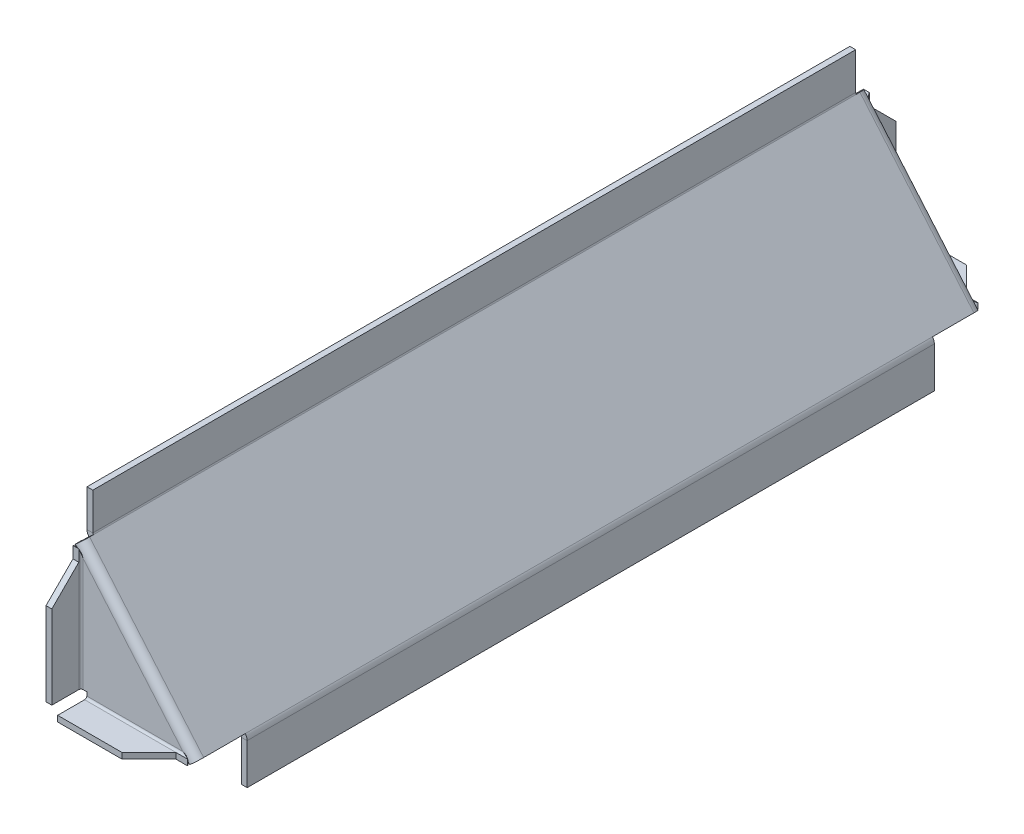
ISO-10303-21;
HEADER;
FILE_DESCRIPTION(('STEP AP214'),'2;1');
FILE_NAME('part.step','',(''),(''),'','','');
FILE_SCHEMA(('AUTOMOTIVE_DESIGN { 1 0 10303 214 1 1 1 1 }'));
ENDSEC;
DATA;
#1=APPLICATION_CONTEXT('core data for automotive mechanical design processes');
#2=APPLICATION_PROTOCOL_DEFINITION('international standard','automotive_design',2000,#1);
#3=PRODUCT_CONTEXT('',#1,'mechanical');
#4=PRODUCT('Part','Part','',(#3));
#5=PRODUCT_RELATED_PRODUCT_CATEGORY('part','',(#4));
#6=PRODUCT_DEFINITION_FORMATION('','',#4);
#7=PRODUCT_DEFINITION_CONTEXT('part definition',#1,'design');
#8=PRODUCT_DEFINITION('design','',#6,#7);
#9=PRODUCT_DEFINITION_SHAPE('','',#8);
#10=(LENGTH_UNIT() NAMED_UNIT(*) SI_UNIT(.MILLI.,.METRE.));
#11=(NAMED_UNIT(*) PLANE_ANGLE_UNIT() SI_UNIT($,.RADIAN.));
#12=(NAMED_UNIT(*) SI_UNIT($,.STERADIAN.) SOLID_ANGLE_UNIT());
#13=UNCERTAINTY_MEASURE_WITH_UNIT(LENGTH_MEASURE(1.E-05),#10,'distance_accuracy_value','');
#14=(GEOMETRIC_REPRESENTATION_CONTEXT(3) GLOBAL_UNCERTAINTY_ASSIGNED_CONTEXT((#13)) GLOBAL_UNIT_ASSIGNED_CONTEXT((#10,
#11,#12)) REPRESENTATION_CONTEXT('',''));
#15=CARTESIAN_POINT('',(0.,0.,0.));
#16=DIRECTION('',(0.,0.,1.));
#17=DIRECTION('',(1.,0.,0.));
#18=AXIS2_PLACEMENT_3D('',#15,#16,#17);
#19=CARTESIAN_POINT('',(19.5929908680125,-59.0068701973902,-0.736599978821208));
#20=DIRECTION('',(-1.13445349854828E-09,2.84911195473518E-08,1.));
#21=DIRECTION('',(-1.,0.,-1.13445349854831E-09));
#22=AXIS2_PLACEMENT_3D('',#19,#20,#21);
#23=PLANE('',#22);
#24=DIRECTION('',(-1.,0.,4.65483207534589E-12));
#25=VECTOR('',#24,1.);
#26=CARTESIAN_POINT('',(19.5929908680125,-61.0068701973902,-0.736599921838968));
#27=LINE('',#26,#25);
#28=CARTESIAN_POINT('',(37.2633999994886,-61.0068701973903,-0.736599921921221));
#29=VERTEX_POINT('',#28);
#30=CARTESIAN_POINT('',(33.2634000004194,-61.0068701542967,-0.736600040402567));
#31=VERTEX_POINT('',#30);
#32=EDGE_CURVE('E606',#29,#31,#27,.T.);
#33=ORIENTED_EDGE('',*,*,#32,.T.);
#34=DIRECTION('',(-9.11531961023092E-12,1.,-1.50563467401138E-12));
#35=VECTOR('',#34,1.);
#36=CARTESIAN_POINT('',(33.2634000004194,-61.0068701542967,-0.736600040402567));
#37=LINE('',#36,#35);
#38=CARTESIAN_POINT('',(33.2634000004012,-59.0068701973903,-0.736599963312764));
#39=VERTEX_POINT('',#38);
#40=EDGE_CURVE('E585',#31,#39,#37,.T.);
#41=ORIENTED_EDGE('',*,*,#40,.T.);
#42=DIRECTION('',(-1.,0.,-1.13445349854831E-09));
#43=VECTOR('',#42,1.);
#44=CARTESIAN_POINT('',(37.2633999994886,-59.0068701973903,-0.73659995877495));
#45=LINE('',#44,#43);
#46=CARTESIAN_POINT('',(37.2633999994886,-59.0068701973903,-0.73659995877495));
#47=VERTEX_POINT('',#46);
#48=EDGE_CURVE('E603',#47,#39,#45,.T.);
#49=ORIENTED_EDGE('',*,*,#48,.F.);
#50=CARTESIAN_POINT('',(37.2633999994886,-61.0068701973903,-0.73659984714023));
#51=CARTESIAN_POINT('',(37.2633999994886,-59.0068701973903,-0.73659995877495));
#52=B_SPLINE_CURVE_WITH_KNOTS('',1,(#50,#51),.UNSPECIFIED.,.F.,.F.,(2,2),(0.,1.),.UNSPECIFIED.);
#53=EDGE_CURVE('E700',#29,#47,#52,.T.);
#54=ORIENTED_EDGE('',*,*,#53,.F.);
#55=EDGE_LOOP('',(#33,#41,#49,#54));
#56=FACE_BOUND('',#55,.T.);
#57=ADVANCED_FACE('F230',(#56),#23,.F.);
#58=CARTESIAN_POINT('',(19.5929908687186,-59.0068701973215,270.736599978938));
#59=DIRECTION('',(-1.15544555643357E-09,2.7688728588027E-08,-1.));
#60=DIRECTION('',(1.,0.,-1.15544555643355E-09));
#61=AXIS2_PLACEMENT_3D('',#58,#59,#60);
#62=PLANE('',#61);
#63=DIRECTION('',(1.,0.,-1.15544555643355E-09));
#64=VECTOR('',#63,1.);
#65=CARTESIAN_POINT('',(1.92258173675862,-59.0068701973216,270.736599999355));
#66=LINE('',#65,#64);
#67=CARTESIAN_POINT('',(33.2634000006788,-59.0068701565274,270.736599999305));
#68=VERTEX_POINT('',#67);
#69=CARTESIAN_POINT('',(37.2634000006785,-59.0068701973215,270.736599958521));
#70=VERTEX_POINT('',#69);
#71=EDGE_CURVE('E1116',#68,#70,#66,.T.);
#72=ORIENTED_EDGE('',*,*,#71,.F.);
#73=DIRECTION('',(0.,-1.,-1.50702245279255E-12));
#74=VECTOR('',#73,1.);
#75=CARTESIAN_POINT('',(33.2634000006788,-59.0068701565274,270.736599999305));
#76=LINE('',#75,#74);
#77=CARTESIAN_POINT('',(33.2634000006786,-61.0068701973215,270.736599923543));
#78=VERTEX_POINT('',#77);
#79=EDGE_CURVE('E2472',#68,#78,#76,.T.);
#80=ORIENTED_EDGE('',*,*,#79,.T.);
#81=DIRECTION('',(1.,0.,-1.28175248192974E-12));
#82=VECTOR('',#81,1.);
#83=CARTESIAN_POINT('',(19.5929908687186,-61.0068701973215,270.73659992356));
#84=LINE('',#83,#82);
#85=CARTESIAN_POINT('',(37.2634000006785,-61.0068701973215,270.736599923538));
#86=VERTEX_POINT('',#85);
#87=EDGE_CURVE('E1619',#78,#86,#84,.T.);
#88=ORIENTED_EDGE('',*,*,#87,.T.);
#89=CARTESIAN_POINT('',(37.2634000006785,-59.0068701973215,270.736599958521));
#90=CARTESIAN_POINT('',(37.2634000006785,-61.0068701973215,270.736599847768));
#91=B_SPLINE_CURVE_WITH_KNOTS('',1,(#89,#90),.UNSPECIFIED.,.F.,.F.,(2,2),(0.,1.),.UNSPECIFIED.);
#92=EDGE_CURVE('E2462',#86,#70,#91,.F.);
#93=ORIENTED_EDGE('',*,*,#92,.T.);
#94=EDGE_LOOP('',(#72,#80,#88,#93));
#95=FACE_BOUND('',#94,.T.);
#96=ADVANCED_FACE('F863',(#95),#62,.F.);
#97=CARTESIAN_POINT('',(17.6775106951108,-37.9934502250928,1.91823206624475E-09));
#98=DIRECTION('',(-0.761539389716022,-0.648118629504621,3.55812329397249E-10));
#99=DIRECTION('',(-0.648118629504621,0.761539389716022,0.));
#100=AXIS2_PLACEMENT_3D('',#97,#98,#99);
#101=PLANE('',#100);
#102=DIRECTION('',(-0.648118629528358,0.76153938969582,0.));
#103=VECTOR('',#102,1.);
#104=CARTESIAN_POINT('',(17.6775106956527,-37.9934502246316,2.00000000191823));
#105=LINE('',#104,#103);
#106=CARTESIAN_POINT('',(37.2633999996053,-61.006870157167,2.00000000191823));
#107=VERTEX_POINT('',#106);
#108=CARTESIAN_POINT('',(34.9343787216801,-58.2702701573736,2.00000004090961));
#109=VERTEX_POINT('',#108);
#110=EDGE_CURVE('E842',#107,#109,#105,.T.);
#111=ORIENTED_EDGE('',*,*,#110,.T.);
#112=CARTESIAN_POINT('',(34.9343787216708,-58.2702701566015,4.0909604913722E-08));
#113=CARTESIAN_POINT('',(34.9343787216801,-58.2702701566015,2.0000000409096));
#114=B_SPLINE_CURVE_WITH_KNOTS('',1,(#112,#113),.UNSPECIFIED.,.F.,.F.,(2,2),(0.,1.),.UNSPECIFIED.);
#115=CARTESIAN_POINT('',(34.9343787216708,-58.2702701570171,4.0909604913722E-08));
#116=VERTEX_POINT('',#115);
#117=EDGE_CURVE('E711',#109,#116,#114,.F.);
#118=ORIENTED_EDGE('',*,*,#117,.T.);
#119=DIRECTION('',(-0.648118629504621,0.761539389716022,0.));
#120=VECTOR('',#119,1.);
#121=CARTESIAN_POINT('',(37.2633999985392,-61.0068701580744,1.91823206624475E-09));
#122=LINE('',#121,#120);
#123=CARTESIAN_POINT('',(37.2633999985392,-61.0068701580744,1.91823206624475E-09));
#124=VERTEX_POINT('',#123);
#125=EDGE_CURVE('E839',#124,#116,#122,.T.);
#126=ORIENTED_EDGE('',*,*,#125,.F.);
#127=DIRECTION('',(-5.33084847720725E-10,-4.53690472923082E-10,-1.));
#128=VECTOR('',#127,1.);
#129=CARTESIAN_POINT('',(37.2633999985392,-61.0068701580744,1.91823206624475E-09));
#130=LINE('',#129,#128);
#131=EDGE_CURVE('E959',#107,#124,#130,.T.);
#132=ORIENTED_EDGE('',*,*,#131,.F.);
#133=EDGE_LOOP('',(#111,#118,#126,#132));
#134=FACE_BOUND('',#133,.T.);
#135=ADVANCED_FACE('F837',(#134),#101,.T.);
#136=CARTESIAN_POINT('',(0.,-13.,270.));
#137=DIRECTION('',(0.761539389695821,0.648118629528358,0.));
#138=DIRECTION('',(-0.648118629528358,0.761539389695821,0.));
#139=AXIS2_PLACEMENT_3D('',#136,#137,#138);
#140=PLANE('',#139);
#141=DIRECTION('',(0.,0.,1.));
#142=VECTOR('',#141,1.);
#143=CARTESIAN_POINT('',(39.3474287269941,-59.233228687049,0.));
#144=LINE('',#143,#142);
#145=CARTESIAN_POINT('',(39.3474286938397,-59.2332287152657,2.73660000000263));
#146=VERTEX_POINT('',#145);
#147=CARTESIAN_POINT('',(39.3474287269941,-59.233228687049,16.9999999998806));
#148=VERTEX_POINT('',#147);
#149=EDGE_CURVE('E1385',#146,#148,#144,.T.);
#150=ORIENTED_EDGE('',*,*,#149,.F.);
#151=DIRECTION('',(-0.648118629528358,0.76153938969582,0.));
#152=VECTOR('',#151,1.);
#153=CARTESIAN_POINT('',(39.3474286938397,-59.2332287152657,2.73660000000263));
#154=LINE('',#153,#152);
#155=CARTESIAN_POINT('',(0.175650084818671,-13.2063888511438,2.73660000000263));
#156=VERTEX_POINT('',#155);
#157=EDGE_CURVE('E984',#146,#156,#154,.T.);
#158=ORIENTED_EDGE('',*,*,#157,.T.);
#159=DIRECTION('',(0.,0.,-1.));
#160=VECTOR('',#159,1.);
#161=CARTESIAN_POINT('',(0.175650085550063,-13.2063888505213,5.26774751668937E-12));
#162=LINE('',#161,#160);
#163=CARTESIAN_POINT('',(0.175650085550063,-13.2063888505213,4.00000000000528));
#164=VERTEX_POINT('',#163);
#165=EDGE_CURVE('E1383',#164,#156,#162,.T.);
#166=ORIENTED_EDGE('',*,*,#165,.F.);
#167=DIRECTION('',(0.,0.,-1.));
#168=VECTOR('',#167,1.);
#169=CARTESIAN_POINT('',(0.175650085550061,-13.2063888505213,270.));
#170=LINE('',#169,#168);
#171=CARTESIAN_POINT('',(0.175650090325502,-13.2063888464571,265.999999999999));
#172=VERTEX_POINT('',#171);
#173=EDGE_CURVE('E1357',#172,#164,#170,.T.);
#174=ORIENTED_EDGE('',*,*,#173,.F.);
#175=DIRECTION('',(0.,0.,-1.));
#176=VECTOR('',#175,1.);
#177=CARTESIAN_POINT('',(0.175650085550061,-13.2063888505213,270.));
#178=LINE('',#177,#176);
#179=CARTESIAN_POINT('',(0.175650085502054,-13.206388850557,267.26339999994));
#180=VERTEX_POINT('',#179);
#181=EDGE_CURVE('E1381',#180,#172,#178,.T.);
#182=ORIENTED_EDGE('',*,*,#181,.F.);
#183=DIRECTION('',(0.648118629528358,-0.761539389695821,0.));
#184=VECTOR('',#183,1.);
#185=CARTESIAN_POINT('',(0.17565008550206,-13.206388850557,267.26339999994));
#186=LINE('',#185,#184);
#187=CARTESIAN_POINT('',(39.347428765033,-59.2332286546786,267.26339999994));
#188=VERTEX_POINT('',#187);
#189=EDGE_CURVE('E1345',#180,#188,#186,.T.);
#190=ORIENTED_EDGE('',*,*,#189,.T.);
#191=DIRECTION('',(0.,0.,-1.));
#192=VECTOR('',#191,1.);
#193=CARTESIAN_POINT('',(39.3474286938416,-59.2332287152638,270.));
#194=LINE('',#193,#192);
#195=CARTESIAN_POINT('',(39.3474287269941,-59.233228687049,252.999999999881));
#196=VERTEX_POINT('',#195);
#197=EDGE_CURVE('E1375',#188,#196,#194,.T.);
#198=ORIENTED_EDGE('',*,*,#197,.T.);
#199=DIRECTION('',(0.,0.,-1.));
#200=VECTOR('',#199,1.);
#201=CARTESIAN_POINT('',(39.3474286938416,-59.2332287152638,270.));
#202=LINE('',#201,#200);
#203=EDGE_CURVE('E1369',#196,#148,#202,.T.);
#204=ORIENTED_EDGE('',*,*,#203,.T.);
#205=EDGE_LOOP('',(#150,#158,#166,#174,#182,#190,#198,#204));
#206=FACE_BOUND('',#205,.T.);
#207=ADVANCED_FACE('F232',(#206),#140,.T.);
#208=CARTESIAN_POINT('',(-1.52307877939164,-14.2962372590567,270.));
#209=DIRECTION('',(0.761539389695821,0.648118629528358,0.));
#210=DIRECTION('',(-0.648118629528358,0.761539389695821,0.));
#211=AXIS2_PLACEMENT_3D('',#208,#209,#210);
#212=PLANE('',#211);
#213=DIRECTION('',(-0.648118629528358,0.76153938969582,0.));
#214=VECTOR('',#213,1.);
#215=CARTESIAN_POINT('',(37.824349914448,-60.5294659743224,2.73660000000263));
#216=LINE('',#215,#214);
#217=CARTESIAN_POINT('',(37.824349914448,-60.5294659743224,2.73660000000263));
#218=VERTEX_POINT('',#217);
#219=CARTESIAN_POINT('',(-1.34742869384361,-14.5026261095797,2.73660000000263));
#220=VERTEX_POINT('',#219);
#221=EDGE_CURVE('E1324',#218,#220,#216,.T.);
#222=ORIENTED_EDGE('',*,*,#221,.F.);
#223=DIRECTION('',(0.,0.,-1.));
#224=VECTOR('',#223,1.);
#225=CARTESIAN_POINT('',(37.8243499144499,-60.5294659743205,270.));
#226=LINE('',#225,#224);
#227=CARTESIAN_POINT('',(37.8243499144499,-60.5294659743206,16.9999999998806));
#228=VERTEX_POINT('',#227);
#229=EDGE_CURVE('E1377',#228,#218,#226,.T.);
#230=ORIENTED_EDGE('',*,*,#229,.F.);
#231=DIRECTION('',(0.,0.,-1.));
#232=VECTOR('',#231,1.);
#233=CARTESIAN_POINT('',(37.8243499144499,-60.5294659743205,270.));
#234=LINE('',#233,#232);
#235=CARTESIAN_POINT('',(37.82434991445,-60.5294659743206,252.999999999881));
#236=VERTEX_POINT('',#235);
#237=EDGE_CURVE('E1363',#236,#228,#234,.T.);
#238=ORIENTED_EDGE('',*,*,#237,.F.);
#239=CARTESIAN_POINT('',(37.8243499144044,-60.5294659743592,267.26339999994));
#240=VERTEX_POINT('',#239);
#241=EDGE_CURVE('E1374',#240,#236,#226,.T.);
#242=ORIENTED_EDGE('',*,*,#241,.F.);
#243=DIRECTION('',(0.648118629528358,-0.761539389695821,0.));
#244=VECTOR('',#243,1.);
#245=CARTESIAN_POINT('',(-1.34742869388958,-14.5026261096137,267.26339999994));
#246=LINE('',#245,#244);
#247=CARTESIAN_POINT('',(-1.34742869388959,-14.5026261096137,267.26339999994));
#248=VERTEX_POINT('',#247);
#249=EDGE_CURVE('E1333',#248,#240,#246,.T.);
#250=ORIENTED_EDGE('',*,*,#249,.F.);
#251=DIRECTION('',(0.,0.,-1.));
#252=VECTOR('',#251,1.);
#253=CARTESIAN_POINT('',(-1.34742869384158,-14.502626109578,270.));
#254=LINE('',#253,#252);
#255=CARTESIAN_POINT('',(-1.34742869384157,-14.502626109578,266.));
#256=VERTEX_POINT('',#255);
#257=EDGE_CURVE('E1378',#248,#256,#254,.T.);
#258=ORIENTED_EDGE('',*,*,#257,.T.);
#259=DIRECTION('',(0.,0.,-1.));
#260=VECTOR('',#259,1.);
#261=CARTESIAN_POINT('',(-1.34742869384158,-14.502626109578,270.));
#262=LINE('',#261,#260);
#263=CARTESIAN_POINT('',(-1.34742869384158,-14.502626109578,4.00000000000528));
#264=VERTEX_POINT('',#263);
#265=EDGE_CURVE('E1351',#256,#264,#262,.T.);
#266=ORIENTED_EDGE('',*,*,#265,.T.);
#267=DIRECTION('',(0.,0.,-1.));
#268=VECTOR('',#267,1.);
#269=CARTESIAN_POINT('',(-1.34742869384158,-14.502626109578,270.));
#270=LINE('',#269,#268);
#271=EDGE_CURVE('E1372',#264,#220,#270,.T.);
#272=ORIENTED_EDGE('',*,*,#271,.T.);
#273=EDGE_LOOP('',(#222,#230,#238,#242,#250,#258,#266,#272));
#274=FACE_BOUND('',#273,.T.);
#275=ADVANCED_FACE('F1087',(#274),#212,.F.);
#276=CARTESIAN_POINT('',(-35.0293818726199,-43.1681181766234,5.26774751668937E-12));
#277=DIRECTION('',(0.648118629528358,-0.761539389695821,0.));
#278=DIRECTION('',(0.761539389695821,0.648118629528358,0.));
#279=AXIS2_PLACEMENT_3D('',#276,#277,#278);
#280=PLANE('',#279);
#281=DIRECTION('',(0.761539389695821,0.648118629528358,0.));
#282=VECTOR('',#281,1.);
#283=CARTESIAN_POINT('',(-1.34742869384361,-14.5026261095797,2.73660000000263));
#284=LINE('',#283,#282);
#285=EDGE_CURVE('E1321',#220,#156,#284,.T.);
#286=ORIENTED_EDGE('',*,*,#285,.F.);
#287=ORIENTED_EDGE('',*,*,#271,.F.);
#288=DIRECTION('',(0.761539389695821,0.648118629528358,0.));
#289=VECTOR('',#288,1.);
#290=CARTESIAN_POINT('',(-35.0293818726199,-43.1681181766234,4.00000000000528));
#291=LINE('',#290,#289);
#292=EDGE_CURVE('E1354',#264,#164,#291,.T.);
#293=ORIENTED_EDGE('',*,*,#292,.T.);
#294=ORIENTED_EDGE('',*,*,#165,.T.);
#295=EDGE_LOOP('',(#286,#287,#293,#294));
#296=FACE_BOUND('',#295,.T.);
#297=ADVANCED_FACE('F1080',(#296),#280,.F.);
#298=CARTESIAN_POINT('',(4.14239673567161,-89.1949580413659,0.));
#299=DIRECTION('',(-0.648118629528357,0.761539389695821,0.));
#300=DIRECTION('',(-0.761539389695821,-0.648118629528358,0.));
#301=AXIS2_PLACEMENT_3D('',#298,#299,#300);
#302=PLANE('',#301);
#303=DIRECTION('',(0.76153938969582,0.648118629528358,0.));
#304=VECTOR('',#303,1.);
#305=CARTESIAN_POINT('',(37.824349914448,-60.5294659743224,2.73660000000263));
#306=LINE('',#305,#304);
#307=EDGE_CURVE('E1326',#218,#146,#306,.T.);
#308=ORIENTED_EDGE('',*,*,#307,.T.);
#309=ORIENTED_EDGE('',*,*,#149,.T.);
#310=DIRECTION('',(0.761539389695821,0.648118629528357,0.));
#311=VECTOR('',#310,1.);
#312=CARTESIAN_POINT('',(4.14239673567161,-89.1949580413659,16.9999999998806));
#313=LINE('',#312,#311);
#314=EDGE_CURVE('E1360',#228,#148,#313,.T.);
#315=ORIENTED_EDGE('',*,*,#314,.F.);
#316=ORIENTED_EDGE('',*,*,#229,.T.);
#317=EDGE_LOOP('',(#308,#309,#315,#316));
#318=FACE_BOUND('',#317,.T.);
#319=ADVANCED_FACE('F1076',(#318),#302,.F.);
#320=CARTESIAN_POINT('',(-35.0293818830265,-43.1681181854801,270.));
#321=DIRECTION('',(0.648118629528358,-0.761539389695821,0.));
#322=DIRECTION('',(0.761539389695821,0.648118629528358,0.));
#323=AXIS2_PLACEMENT_3D('',#320,#321,#322);
#324=PLANE('',#323);
#325=DIRECTION('',(0.761539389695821,0.648118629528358,0.));
#326=VECTOR('',#325,1.);
#327=CARTESIAN_POINT('',(-1.34742869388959,-14.5026261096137,267.26339999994));
#328=LINE('',#327,#326);
#329=EDGE_CURVE('E1340',#248,#180,#328,.T.);
#330=ORIENTED_EDGE('',*,*,#329,.T.);
#331=ORIENTED_EDGE('',*,*,#181,.T.);
#332=DIRECTION('',(0.761539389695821,0.648118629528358,0.));
#333=VECTOR('',#332,1.);
#334=CARTESIAN_POINT('',(-35.0293818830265,-43.1681181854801,266.));
#335=LINE('',#334,#333);
#336=EDGE_CURVE('E1348',#256,#172,#335,.T.);
#337=ORIENTED_EDGE('',*,*,#336,.F.);
#338=ORIENTED_EDGE('',*,*,#257,.F.);
#339=EDGE_LOOP('',(#330,#331,#337,#338));
#340=FACE_BOUND('',#339,.T.);
#341=ADVANCED_FACE('F1079',(#340),#324,.F.);
#342=CARTESIAN_POINT('',(4.14239673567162,-89.1949580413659,269.999999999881));
#343=DIRECTION('',(-0.648118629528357,0.761539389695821,0.));
#344=DIRECTION('',(-0.761539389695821,-0.648118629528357,0.));
#345=AXIS2_PLACEMENT_3D('',#342,#343,#344);
#346=PLANE('',#345);
#347=DIRECTION('',(0.761539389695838,0.648118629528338,0.));
#348=VECTOR('',#347,1.);
#349=CARTESIAN_POINT('',(37.8243499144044,-60.5294659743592,267.26339999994));
#350=LINE('',#349,#348);
#351=EDGE_CURVE('E1330',#240,#188,#350,.T.);
#352=ORIENTED_EDGE('',*,*,#351,.F.);
#353=ORIENTED_EDGE('',*,*,#241,.T.);
#354=DIRECTION('',(0.761539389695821,0.648118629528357,0.));
#355=VECTOR('',#354,1.);
#356=CARTESIAN_POINT('',(4.14239673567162,-89.1949580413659,252.999999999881));
#357=LINE('',#356,#355);
#358=EDGE_CURVE('E1366',#236,#196,#357,.T.);
#359=ORIENTED_EDGE('',*,*,#358,.T.);
#360=ORIENTED_EDGE('',*,*,#197,.F.);
#361=EDGE_LOOP('',(#352,#353,#359,#360));
#362=FACE_BOUND('',#361,.T.);
#363=ADVANCED_FACE('F1074',(#362),#346,.F.);
#364=CARTESIAN_POINT('',(37.2633999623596,-61.0068701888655,16.9999999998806));
#365=DIRECTION('',(0.,0.,-1.));
#366=DIRECTION('',(-1.,0.,0.));
#367=AXIS2_PLACEMENT_3D('',#364,#365,#366);
#368=PLANE('',#367);
#369=DIRECTION('',(-1.,-2.1032630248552E-08,0.));
#370=VECTOR('',#369,1.);
#371=CARTESIAN_POINT('',(39.9999999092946,-61.0068701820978,17.0000000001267));
#372=LINE('',#371,#370);
#373=CARTESIAN_POINT('',(40.0000000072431,-61.0068700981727,16.9999999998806));
#374=VERTEX_POINT('',#373);
#375=CARTESIAN_POINT('',(37.9999999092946,-61.0068702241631,17.0000000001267));
#376=VERTEX_POINT('',#375);
#377=EDGE_CURVE('E1403',#374,#376,#372,.T.);
#378=ORIENTED_EDGE('',*,*,#377,.T.);
#379=CARTESIAN_POINT('',(37.2634,-61.0068701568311,16.9999999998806));
#380=DIRECTION('',(0.,0.,-1.));
#381=DIRECTION('',(-1.,0.,0.));
#382=AXIS2_PLACEMENT_3D('',#379,#380,#381);
#383=CIRCLE('',#382,0.736600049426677);
#384=EDGE_CURVE('E1388',#376,#228,#383,.F.);
#385=ORIENTED_EDGE('',*,*,#384,.T.);
#386=ORIENTED_EDGE('',*,*,#314,.T.);
#387=CARTESIAN_POINT('',(37.2633999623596,-61.0068701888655,16.9999999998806));
#388=DIRECTION('',(0.,0.,1.));
#389=DIRECTION('',(1.,0.,0.));
#390=AXIS2_PLACEMENT_3D('',#387,#388,#389);
#391=CIRCLE('',#390,2.7366000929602);
#392=EDGE_CURVE('E1395',#374,#148,#391,.T.);
#393=ORIENTED_EDGE('',*,*,#392,.F.);
#394=EDGE_LOOP('',(#378,#385,#386,#393));
#395=FACE_BOUND('',#394,.T.);
#396=ADVANCED_FACE('F1070',(#395),#368,.T.);
#397=CARTESIAN_POINT('',(37.2633999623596,-61.0068701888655,252.999999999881));
#398=DIRECTION('',(-8.58387678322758E-11,1.00860552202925E-10,1.));
#399=DIRECTION('',(0.,-1.,1.00860552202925E-10));
#400=AXIS2_PLACEMENT_3D('',#397,#398,#399);
#401=PLANE('',#400);
#402=ORIENTED_EDGE('',*,*,#358,.F.);
#403=CARTESIAN_POINT('',(37.2633999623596,-61.0068701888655,252.999999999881));
#404=DIRECTION('',(8.58387678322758E-11,-1.00860552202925E-10,-1.));
#405=DIRECTION('',(0.,1.,-1.00860552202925E-10));
#406=AXIS2_PLACEMENT_3D('',#403,#404,#405);
#407=CIRCLE('',#406,0.736600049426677);
#408=CARTESIAN_POINT('',(37.9999999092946,-61.0068702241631,253.000000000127));
#409=VERTEX_POINT('',#408);
#410=EDGE_CURVE('E1391',#236,#409,#407,.T.);
#411=ORIENTED_EDGE('',*,*,#410,.T.);
#412=DIRECTION('',(1.,2.10326279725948E-08,0.));
#413=VECTOR('',#412,1.);
#414=CARTESIAN_POINT('',(37.9999999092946,-61.0068702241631,253.000000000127));
#415=LINE('',#414,#413);
#416=CARTESIAN_POINT('',(40.0000000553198,-61.0068701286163,253.000000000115));
#417=VERTEX_POINT('',#416);
#418=EDGE_CURVE('E1407',#409,#417,#415,.T.);
#419=ORIENTED_EDGE('',*,*,#418,.T.);
#420=CARTESIAN_POINT('',(37.2633999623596,-61.0068701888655,252.999999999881));
#421=DIRECTION('',(8.58387678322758E-11,-1.00860552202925E-10,-1.));
#422=DIRECTION('',(0.,1.,-1.00860552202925E-10));
#423=AXIS2_PLACEMENT_3D('',#420,#421,#422);
#424=CIRCLE('',#423,2.7366000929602);
#425=EDGE_CURVE('E1387',#196,#417,#424,.T.);
#426=ORIENTED_EDGE('',*,*,#425,.F.);
#427=EDGE_LOOP('',(#402,#411,#419,#426));
#428=FACE_BOUND('',#427,.T.);
#429=ADVANCED_FACE('F1063',(#428),#401,.T.);
#430=CARTESIAN_POINT('',(37.2634,-61.0068701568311,371.021893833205));
#431=DIRECTION('',(0.,0.,-1.));
#432=DIRECTION('',(-1.,0.,0.));
#433=AXIS2_PLACEMENT_3D('',#430,#431,#432);
#434=CYLINDRICAL_SURFACE('',#433,2.73660004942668);
#435=ORIENTED_EDGE('',*,*,#425,.T.);
#436=DIRECTION('',(0.,0.,-1.));
#437=VECTOR('',#436,1.);
#438=CARTESIAN_POINT('',(39.9999999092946,-61.0068702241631,270.000000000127));
#439=LINE('',#438,#437);
#440=EDGE_CURVE('E1400',#417,#374,#439,.T.);
#441=ORIENTED_EDGE('',*,*,#440,.T.);
#442=ORIENTED_EDGE('',*,*,#392,.T.);
#443=ORIENTED_EDGE('',*,*,#203,.F.);
#444=EDGE_LOOP('',(#435,#441,#442,#443));
#445=FACE_BOUND('',#444,.T.);
#446=ADVANCED_FACE('F1060',(#445),#434,.T.);
#447=CARTESIAN_POINT('',(37.2634,-61.0068701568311,371.021893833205));
#448=DIRECTION('',(0.,0.,-1.));
#449=DIRECTION('',(-1.,0.,0.));
#450=AXIS2_PLACEMENT_3D('',#447,#448,#449);
#451=CYLINDRICAL_SURFACE('',#450,0.736600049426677);
#452=ORIENTED_EDGE('',*,*,#410,.F.);
#453=ORIENTED_EDGE('',*,*,#237,.T.);
#454=ORIENTED_EDGE('',*,*,#384,.F.);
#455=DIRECTION('',(0.,0.,-1.));
#456=VECTOR('',#455,1.);
#457=CARTESIAN_POINT('',(37.9999999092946,-61.0068702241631,270.000000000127));
#458=LINE('',#457,#456);
#459=EDGE_CURVE('E1424',#409,#376,#458,.T.);
#460=ORIENTED_EDGE('',*,*,#459,.F.);
#461=EDGE_LOOP('',(#452,#453,#454,#460));
#462=FACE_BOUND('',#461,.T.);
#463=ADVANCED_FACE('F1044',(#462),#451,.F.);
#464=CARTESIAN_POINT('',(39.9999999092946,-75.0000000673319,270.000000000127));
#465=DIRECTION('',(0.,-1.,0.));
#466=DIRECTION('',(0.,0.,-1.));
#467=AXIS2_PLACEMENT_3D('',#464,#465,#466);
#468=PLANE('',#467);
#469=DIRECTION('',(1.,0.,0.));
#470=VECTOR('',#469,1.);
#471=CARTESIAN_POINT('',(-6.22877363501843,-75.000000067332,17.0000000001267));
#472=LINE('',#471,#470);
#473=CARTESIAN_POINT('',(37.9999999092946,-75.000000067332,17.0000000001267));
#474=VERTEX_POINT('',#473);
#475=CARTESIAN_POINT('',(39.9999999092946,-75.000000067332,17.0000000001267));
#476=VERTEX_POINT('',#475);
#477=EDGE_CURVE('E1410',#474,#476,#472,.T.);
#478=ORIENTED_EDGE('',*,*,#477,.T.);
#479=DIRECTION('',(0.,0.,-1.));
#480=VECTOR('',#479,1.);
#481=CARTESIAN_POINT('',(39.9999999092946,-75.0000000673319,270.000000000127));
#482=LINE('',#481,#480);
#483=CARTESIAN_POINT('',(39.9999999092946,-75.000000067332,253.000000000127));
#484=VERTEX_POINT('',#483);
#485=EDGE_CURVE('E1416',#484,#476,#482,.T.);
#486=ORIENTED_EDGE('',*,*,#485,.F.);
#487=DIRECTION('',(1.,0.,0.));
#488=VECTOR('',#487,1.);
#489=CARTESIAN_POINT('',(-6.22877363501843,-75.000000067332,253.000000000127));
#490=LINE('',#489,#488);
#491=CARTESIAN_POINT('',(37.9999999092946,-75.000000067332,253.000000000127));
#492=VERTEX_POINT('',#491);
#493=EDGE_CURVE('E1419',#492,#484,#490,.T.);
#494=ORIENTED_EDGE('',*,*,#493,.F.);
#495=DIRECTION('',(0.,0.,-1.));
#496=VECTOR('',#495,1.);
#497=CARTESIAN_POINT('',(37.9999999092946,-75.000000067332,270.000000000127));
#498=LINE('',#497,#496);
#499=EDGE_CURVE('E1413',#492,#474,#498,.T.);
#500=ORIENTED_EDGE('',*,*,#499,.T.);
#501=EDGE_LOOP('',(#478,#486,#494,#500));
#502=FACE_BOUND('',#501,.T.);
#503=ADVANCED_FACE('F1040',(#502),#468,.T.);
#504=CARTESIAN_POINT('',(39.9999999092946,-60.0000000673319,270.000000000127));
#505=DIRECTION('',(1.,0.,0.));
#506=DIRECTION('',(0.,0.,-1.));
#507=AXIS2_PLACEMENT_3D('',#504,#505,#506);
#508=PLANE('',#507);
#509=DIRECTION('',(0.,-1.,0.));
#510=VECTOR('',#509,1.);
#511=CARTESIAN_POINT('',(39.9999999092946,-75.000000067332,17.0000000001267));
#512=LINE('',#511,#510);
#513=EDGE_CURVE('E1392',#374,#476,#512,.T.);
#514=ORIENTED_EDGE('',*,*,#513,.F.);
#515=ORIENTED_EDGE('',*,*,#440,.F.);
#516=DIRECTION('',(0.,1.,0.));
#517=VECTOR('',#516,1.);
#518=CARTESIAN_POINT('',(39.9999999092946,-75.000000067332,253.000000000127));
#519=LINE('',#518,#517);
#520=EDGE_CURVE('E1421',#484,#417,#519,.T.);
#521=ORIENTED_EDGE('',*,*,#520,.F.);
#522=ORIENTED_EDGE('',*,*,#485,.T.);
#523=EDGE_LOOP('',(#514,#515,#521,#522));
#524=FACE_BOUND('',#523,.T.);
#525=ADVANCED_FACE('F1043',(#524),#508,.T.);
#526=CARTESIAN_POINT('',(-6.22877363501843,-75.000000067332,253.000000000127));
#527=DIRECTION('',(0.,0.,-1.));
#528=DIRECTION('',(-0.761539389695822,0.648118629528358,0.));
#529=AXIS2_PLACEMENT_3D('',#526,#527,#528);
#530=PLANE('',#529);
#531=ORIENTED_EDGE('',*,*,#418,.F.);
#532=DIRECTION('',(0.,1.,0.));
#533=VECTOR('',#532,1.);
#534=CARTESIAN_POINT('',(37.9999999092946,-60.0000000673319,253.000000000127));
#535=LINE('',#534,#533);
#536=EDGE_CURVE('E1430',#492,#409,#535,.T.);
#537=ORIENTED_EDGE('',*,*,#536,.F.);
#538=ORIENTED_EDGE('',*,*,#493,.T.);
#539=ORIENTED_EDGE('',*,*,#520,.T.);
#540=EDGE_LOOP('',(#531,#537,#538,#539));
#541=FACE_BOUND('',#540,.T.);
#542=ADVANCED_FACE('F1048',(#541),#530,.F.);
#543=CARTESIAN_POINT('',(37.9999999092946,-60.0000000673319,270.000000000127));
#544=DIRECTION('',(1.,0.,0.));
#545=DIRECTION('',(0.,0.,-1.));
#546=AXIS2_PLACEMENT_3D('',#543,#544,#545);
#547=PLANE('',#546);
#548=ORIENTED_EDGE('',*,*,#459,.T.);
#549=DIRECTION('',(0.,-1.,0.));
#550=VECTOR('',#549,1.);
#551=CARTESIAN_POINT('',(37.9999999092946,-60.0000000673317,17.0000000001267));
#552=LINE('',#551,#550);
#553=EDGE_CURVE('E1427',#376,#474,#552,.T.);
#554=ORIENTED_EDGE('',*,*,#553,.T.);
#555=ORIENTED_EDGE('',*,*,#499,.F.);
#556=ORIENTED_EDGE('',*,*,#536,.T.);
#557=EDGE_LOOP('',(#548,#554,#555,#556));
#558=FACE_BOUND('',#557,.T.);
#559=ADVANCED_FACE('F1052',(#558),#547,.F.);
#560=CARTESIAN_POINT('',(-6.22877363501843,-75.000000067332,17.0000000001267));
#561=DIRECTION('',(0.,0.,1.));
#562=DIRECTION('',(-0.648118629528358,-0.761539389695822,0.));
#563=AXIS2_PLACEMENT_3D('',#560,#561,#562);
#564=PLANE('',#563);
#565=ORIENTED_EDGE('',*,*,#377,.F.);
#566=ORIENTED_EDGE('',*,*,#513,.T.);
#567=ORIENTED_EDGE('',*,*,#477,.F.);
#568=ORIENTED_EDGE('',*,*,#553,.F.);
#569=EDGE_LOOP('',(#565,#566,#567,#568));
#570=FACE_BOUND('',#569,.T.);
#571=ADVANCED_FACE('F1038',(#570),#564,.F.);
#572=CARTESIAN_POINT('',(0.73659999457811,-12.7289846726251,4.00000000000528));
#573=DIRECTION('',(0.,0.,1.));
#574=DIRECTION('',(1.,0.,0.));
#575=AXIS2_PLACEMENT_3D('',#572,#573,#574);
#576=PLANE('',#575);
#577=ORIENTED_EDGE('',*,*,#292,.F.);
#578=CARTESIAN_POINT('',(0.736600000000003,-12.7289846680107,4.00000000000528));
#579=DIRECTION('',(0.,0.,1.));
#580=DIRECTION('',(1.,0.,0.));
#581=AXIS2_PLACEMENT_3D('',#578,#579,#580);
#582=CIRCLE('',#581,2.73659999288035);
#583=CARTESIAN_POINT('',(-2.00000000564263,-12.7289846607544,3.99999999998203));
#584=VERTEX_POINT('',#583);
#585=EDGE_CURVE('E1433',#264,#584,#582,.F.);
#586=ORIENTED_EDGE('',*,*,#585,.T.);
#587=DIRECTION('',(1.,0.,0.));
#588=VECTOR('',#587,1.);
#589=CARTESIAN_POINT('',(-2.00000000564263,-12.7289846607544,3.99999999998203));
#590=LINE('',#589,#588);
#591=CARTESIAN_POINT('',(2.3259033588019E-09,-12.7289846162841,4.00000000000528));
#592=VERTEX_POINT('',#591);
#593=EDGE_CURVE('E1452',#584,#592,#590,.T.);
#594=ORIENTED_EDGE('',*,*,#593,.T.);
#595=CARTESIAN_POINT('',(0.73659999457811,-12.7289846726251,4.00000000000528));
#596=DIRECTION('',(0.,0.,-1.));
#597=DIRECTION('',(-1.,0.,0.));
#598=AXIS2_PLACEMENT_3D('',#595,#596,#597);
#599=CIRCLE('',#598,0.736599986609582);
#600=EDGE_CURVE('E1440',#164,#592,#599,.T.);
#601=ORIENTED_EDGE('',*,*,#600,.F.);
#602=EDGE_LOOP('',(#577,#586,#594,#601));
#603=FACE_BOUND('',#602,.T.);
#604=ADVANCED_FACE('F1034',(#603),#576,.F.);
#605=CARTESIAN_POINT('',(0.73659999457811,-12.7289846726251,265.999999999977));
#606=DIRECTION('',(0.,-4.59959094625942E-11,-1.));
#607=DIRECTION('',(0.,1.,-4.59959094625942E-11));
#608=AXIS2_PLACEMENT_3D('',#605,#606,#607);
#609=PLANE('',#608);
#610=DIRECTION('',(-1.,0.,0.));
#611=VECTOR('',#610,1.);
#612=CARTESIAN_POINT('',(-5.64262178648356E-09,-12.7289846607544,265.999999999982));
#613=LINE('',#612,#611);
#614=CARTESIAN_POINT('',(7.11965068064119E-09,-12.7289846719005,265.999999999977));
#615=VERTEX_POINT('',#614);
#616=CARTESIAN_POINT('',(-2.00000000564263,-12.7289846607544,265.999999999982));
#617=VERTEX_POINT('',#616);
#618=EDGE_CURVE('E1445',#615,#617,#613,.T.);
#619=ORIENTED_EDGE('',*,*,#618,.T.);
#620=CARTESIAN_POINT('',(0.73659999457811,-12.7289846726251,265.999999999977));
#621=DIRECTION('',(0.,4.59959094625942E-11,1.));
#622=DIRECTION('',(0.,-1.,4.59959094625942E-11));
#623=AXIS2_PLACEMENT_3D('',#620,#621,#622);
#624=CIRCLE('',#623,2.73659999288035);
#625=EDGE_CURVE('E1436',#617,#256,#624,.T.);
#626=ORIENTED_EDGE('',*,*,#625,.T.);
#627=ORIENTED_EDGE('',*,*,#336,.T.);
#628=CARTESIAN_POINT('',(0.73659999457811,-12.7289846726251,265.999999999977));
#629=DIRECTION('',(0.,4.59959094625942E-11,1.));
#630=DIRECTION('',(0.,-1.,4.59959094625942E-11));
#631=AXIS2_PLACEMENT_3D('',#628,#629,#630);
#632=CIRCLE('',#631,0.736599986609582);
#633=EDGE_CURVE('E1404',#615,#172,#632,.T.);
#634=ORIENTED_EDGE('',*,*,#633,.F.);
#635=EDGE_LOOP('',(#619,#626,#627,#634));
#636=FACE_BOUND('',#635,.T.);
#637=ADVANCED_FACE('F1027',(#636),#609,.F.);
#638=CARTESIAN_POINT('',(0.736600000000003,-12.7289846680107,-127.019721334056));
#639=DIRECTION('',(0.,0.,1.));
#640=DIRECTION('',(1.,0.,0.));
#641=AXIS2_PLACEMENT_3D('',#638,#639,#640);
#642=CYLINDRICAL_SURFACE('',#641,0.736599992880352);
#643=ORIENTED_EDGE('',*,*,#633,.T.);
#644=ORIENTED_EDGE('',*,*,#173,.T.);
#645=ORIENTED_EDGE('',*,*,#600,.T.);
#646=DIRECTION('',(0.,0.,-1.));
#647=VECTOR('',#646,1.);
#648=CARTESIAN_POINT('',(-5.64262178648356E-09,-12.7289846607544,269.999999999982));
#649=LINE('',#648,#647);
#650=EDGE_CURVE('E1461',#615,#592,#649,.T.);
#651=ORIENTED_EDGE('',*,*,#650,.F.);
#652=EDGE_LOOP('',(#643,#644,#645,#651));
#653=FACE_BOUND('',#652,.T.);
#654=ADVANCED_FACE('F1024',(#653),#642,.F.);
#655=CARTESIAN_POINT('',(0.736600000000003,-12.7289846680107,-127.019721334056));
#656=DIRECTION('',(0.,0.,1.));
#657=DIRECTION('',(1.,0.,0.));
#658=AXIS2_PLACEMENT_3D('',#655,#656,#657);
#659=CYLINDRICAL_SURFACE('',#658,2.73659999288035);
#660=ORIENTED_EDGE('',*,*,#625,.F.);
#661=DIRECTION('',(0.,0.,-1.));
#662=VECTOR('',#661,1.);
#663=CARTESIAN_POINT('',(-2.00000000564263,-12.7289846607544,269.999999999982));
#664=LINE('',#663,#662);
#665=EDGE_CURVE('E1448',#617,#584,#664,.T.);
#666=ORIENTED_EDGE('',*,*,#665,.T.);
#667=ORIENTED_EDGE('',*,*,#585,.F.);
#668=ORIENTED_EDGE('',*,*,#265,.F.);
#669=EDGE_LOOP('',(#660,#666,#667,#668));
#670=FACE_BOUND('',#669,.T.);
#671=ADVANCED_FACE('F1008',(#670),#659,.T.);
#672=CARTESIAN_POINT('',(-2.00000000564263,7.25634266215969E-09,269.999999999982));
#673=DIRECTION('',(0.,1.,0.));
#674=DIRECTION('',(-1.,0.,0.));
#675=AXIS2_PLACEMENT_3D('',#672,#673,#674);
#676=PLANE('',#675);
#677=DIRECTION('',(1.,0.,0.));
#678=VECTOR('',#677,1.);
#679=CARTESIAN_POINT('',(-46.2287734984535,7.25636564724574E-09,3.99999999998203));
#680=LINE('',#679,#678);
#681=CARTESIAN_POINT('',(-2.00000000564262,7.25633919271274E-09,3.99999999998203));
#682=VERTEX_POINT('',#681);
#683=CARTESIAN_POINT('',(2.32591203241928E-09,7.25634352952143E-09,3.99999999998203));
#684=VERTEX_POINT('',#683);
#685=EDGE_CURVE('E1464',#682,#684,#680,.T.);
#686=ORIENTED_EDGE('',*,*,#685,.F.);
#687=DIRECTION('',(0.,0.,-1.));
#688=VECTOR('',#687,1.);
#689=CARTESIAN_POINT('',(-2.00000000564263,7.25634266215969E-09,269.999999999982));
#690=LINE('',#689,#688);
#691=CARTESIAN_POINT('',(-2.00000000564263,7.25634266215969E-09,265.999999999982));
#692=VERTEX_POINT('',#691);
#693=EDGE_CURVE('E1468',#692,#682,#690,.T.);
#694=ORIENTED_EDGE('',*,*,#693,.F.);
#695=DIRECTION('',(1.,0.,0.));
#696=VECTOR('',#695,1.);
#697=CARTESIAN_POINT('',(-46.2287735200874,7.2563691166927E-09,265.999999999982));
#698=LINE('',#697,#696);
#699=CARTESIAN_POINT('',(-5.64261658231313E-09,7.25634396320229E-09,265.999999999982));
#700=VERTEX_POINT('',#699);
#701=EDGE_CURVE('E1455',#692,#700,#698,.T.);
#702=ORIENTED_EDGE('',*,*,#701,.T.);
#703=DIRECTION('',(0.,0.,-1.));
#704=VECTOR('',#703,1.);
#705=CARTESIAN_POINT('',(-5.64262525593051E-09,7.25634439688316E-09,269.999999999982));
#706=LINE('',#705,#704);
#707=EDGE_CURVE('E1458',#700,#684,#706,.T.);
#708=ORIENTED_EDGE('',*,*,#707,.T.);
#709=EDGE_LOOP('',(#686,#694,#702,#708));
#710=FACE_BOUND('',#709,.T.);
#711=ADVANCED_FACE('F1004',(#710),#676,.T.);
#712=CARTESIAN_POINT('',(-5.64262525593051E-09,7.25634439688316E-09,269.999999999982));
#713=DIRECTION('',(1.,0.,0.));
#714=DIRECTION('',(0.,1.,0.));
#715=AXIS2_PLACEMENT_3D('',#712,#713,#714);
#716=PLANE('',#715);
#717=DIRECTION('',(0.,-1.,0.));
#718=VECTOR('',#717,1.);
#719=CARTESIAN_POINT('',(2.32591203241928E-09,7.25634352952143E-09,3.99999999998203));
#720=LINE('',#719,#718);
#721=EDGE_CURVE('E1466',#684,#592,#720,.T.);
#722=ORIENTED_EDGE('',*,*,#721,.F.);
#723=ORIENTED_EDGE('',*,*,#707,.F.);
#724=DIRECTION('',(0.,1.,0.));
#725=VECTOR('',#724,1.);
#726=CARTESIAN_POINT('',(-5.64261658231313E-09,7.25634396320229E-09,265.999999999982));
#727=LINE('',#726,#725);
#728=EDGE_CURVE('E1437',#615,#700,#727,.T.);
#729=ORIENTED_EDGE('',*,*,#728,.F.);
#730=ORIENTED_EDGE('',*,*,#650,.T.);
#731=EDGE_LOOP('',(#722,#723,#729,#730));
#732=FACE_BOUND('',#731,.T.);
#733=ADVANCED_FACE('F1007',(#732),#716,.T.);
#734=CARTESIAN_POINT('',(-46.2287734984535,7.25636564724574E-09,3.99999999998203));
#735=DIRECTION('',(0.,0.,1.));
#736=DIRECTION('',(-0.648118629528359,-0.76153938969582,0.));
#737=AXIS2_PLACEMENT_3D('',#734,#735,#736);
#738=PLANE('',#737);
#739=ORIENTED_EDGE('',*,*,#593,.F.);
#740=DIRECTION('',(0.,-1.,0.));
#741=VECTOR('',#740,1.);
#742=CARTESIAN_POINT('',(-2.00000000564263,7.25627587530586E-09,3.99999999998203));
#743=LINE('',#742,#741);
#744=EDGE_CURVE('E1471',#682,#584,#743,.T.);
#745=ORIENTED_EDGE('',*,*,#744,.F.);
#746=ORIENTED_EDGE('',*,*,#685,.T.);
#747=ORIENTED_EDGE('',*,*,#721,.T.);
#748=EDGE_LOOP('',(#739,#745,#746,#747));
#749=FACE_BOUND('',#748,.T.);
#750=ADVANCED_FACE('F1012',(#749),#738,.F.);
#751=CARTESIAN_POINT('',(-2.00000000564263,7.25634266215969E-09,269.999999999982));
#752=DIRECTION('',(1.,0.,0.));
#753=DIRECTION('',(0.,1.,0.));
#754=AXIS2_PLACEMENT_3D('',#751,#752,#753);
#755=PLANE('',#754);
#756=ORIENTED_EDGE('',*,*,#693,.T.);
#757=ORIENTED_EDGE('',*,*,#744,.T.);
#758=ORIENTED_EDGE('',*,*,#665,.F.);
#759=DIRECTION('',(0.,1.,0.));
#760=VECTOR('',#759,1.);
#761=CARTESIAN_POINT('',(-2.00000000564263,7.25634266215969E-09,265.999999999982));
#762=LINE('',#761,#760);
#763=EDGE_CURVE('E1473',#617,#692,#762,.T.);
#764=ORIENTED_EDGE('',*,*,#763,.T.);
#765=EDGE_LOOP('',(#756,#757,#758,#764));
#766=FACE_BOUND('',#765,.T.);
#767=ADVANCED_FACE('F1016',(#766),#755,.F.);
#768=CARTESIAN_POINT('',(-46.2287735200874,7.2563691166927E-09,265.999999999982));
#769=DIRECTION('',(0.,0.,-1.));
#770=DIRECTION('',(-0.76153938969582,0.648118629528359,0.));
#771=AXIS2_PLACEMENT_3D('',#768,#769,#770);
#772=PLANE('',#771);
#773=ORIENTED_EDGE('',*,*,#618,.F.);
#774=ORIENTED_EDGE('',*,*,#728,.T.);
#775=ORIENTED_EDGE('',*,*,#701,.F.);
#776=ORIENTED_EDGE('',*,*,#763,.F.);
#777=EDGE_LOOP('',(#773,#774,#775,#776));
#778=FACE_BOUND('',#777,.T.);
#779=ADVANCED_FACE('F997',(#778),#772,.F.);
#780=CARTESIAN_POINT('',(17.6775107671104,-37.9934501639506,270.000000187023));
#781=DIRECTION('',(-0.761539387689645,-0.648118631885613,3.41815582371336E-08));
#782=DIRECTION('',(0.648118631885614,-0.761539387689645,0.));
#783=AXIS2_PLACEMENT_3D('',#780,#781,#782);
#784=PLANE('',#783);
#785=CARTESIAN_POINT('',(34.9343787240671,-58.2702701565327,267.999999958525));
#786=CARTESIAN_POINT('',(34.9343787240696,-58.2702701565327,269.999999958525));
#787=B_SPLINE_CURVE_WITH_KNOTS('',1,(#785,#786),.UNSPECIFIED.,.F.,.F.,(2,2),(0.,1.),.UNSPECIFIED.);
#788=CARTESIAN_POINT('',(34.934378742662,-58.2702701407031,268.000000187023));
#789=VERTEX_POINT('',#788);
#790=CARTESIAN_POINT('',(34.9343787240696,-58.2702701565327,269.999999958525));
#791=VERTEX_POINT('',#790);
#792=EDGE_CURVE('E978',#789,#791,#787,.T.);
#793=ORIENTED_EDGE('',*,*,#792,.F.);
#794=DIRECTION('',(0.648118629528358,-0.761539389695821,0.));
#795=VECTOR('',#794,1.);
#796=CARTESIAN_POINT('',(17.6775107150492,-37.993450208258,268.000000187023));
#797=LINE('',#796,#795);
#798=CARTESIAN_POINT('',(37.2634000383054,-61.006870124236,268.000000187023));
#799=VERTEX_POINT('',#798);
#800=EDGE_CURVE('E912',#789,#799,#797,.T.);
#801=ORIENTED_EDGE('',*,*,#800,.T.);
#802=DIRECTION('',(5.2061209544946E-08,4.43074030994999E-08,0.999999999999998));
#803=VECTOR('',#802,1.);
#804=CARTESIAN_POINT('',(37.2634001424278,-61.0068700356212,270.000000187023));
#805=LINE('',#804,#803);
#806=CARTESIAN_POINT('',(37.2634001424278,-61.0068700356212,270.000000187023));
#807=VERTEX_POINT('',#806);
#808=EDGE_CURVE('E1449',#799,#807,#805,.T.);
#809=ORIENTED_EDGE('',*,*,#808,.T.);
#810=DIRECTION('',(0.648118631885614,-0.761539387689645,0.));
#811=VECTOR('',#810,1.);
#812=CARTESIAN_POINT('',(-1.90837860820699,-14.98003029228,270.000000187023));
#813=LINE('',#812,#811);
#814=EDGE_CURVE('E967',#791,#807,#813,.T.);
#815=ORIENTED_EDGE('',*,*,#814,.F.);
#816=EDGE_LOOP('',(#793,#801,#809,#815));
#817=FACE_BOUND('',#816,.T.);
#818=ADVANCED_FACE('F986',(#817),#784,.T.);
#819=CARTESIAN_POINT('',(37.2633998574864,-61.0068702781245,267.26339999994));
#820=DIRECTION('',(0.648118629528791,-0.761539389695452,0.));
#821=DIRECTION('',(0.761539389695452,0.648118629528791,0.));
#822=AXIS2_PLACEMENT_3D('',#819,#820,#821);
#823=PLANE('',#822);
#824=ORIENTED_EDGE('',*,*,#808,.F.);
#825=CARTESIAN_POINT('',(37.2633999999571,-61.0068701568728,267.26339999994));
#826=DIRECTION('',(0.648118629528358,-0.761539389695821,0.));
#827=DIRECTION('',(0.761539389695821,0.648118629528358,0.));
#828=AXIS2_PLACEMENT_3D('',#825,#826,#827);
#829=CIRCLE('',#828,0.736600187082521);
#830=EDGE_CURVE('E1481',#799,#240,#829,.F.);
#831=ORIENTED_EDGE('',*,*,#830,.T.);
#832=ORIENTED_EDGE('',*,*,#351,.T.);
#833=CARTESIAN_POINT('',(37.2633998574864,-61.0068702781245,267.26339999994));
#834=DIRECTION('',(-0.648118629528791,0.761539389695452,0.));
#835=DIRECTION('',(-0.761539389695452,-0.648118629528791,0.));
#836=AXIS2_PLACEMENT_3D('',#833,#834,#835);
#837=CIRCLE('',#836,2.73660028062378);
#838=EDGE_CURVE('E964',#807,#188,#837,.T.);
#839=ORIENTED_EDGE('',*,*,#838,.F.);
#840=EDGE_LOOP('',(#824,#831,#832,#839));
#841=FACE_BOUND('',#840,.T.);
#842=ADVANCED_FACE('F996',(#841),#823,.T.);
#843=CARTESIAN_POINT('',(-1.90837875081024,-14.980030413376,267.26339999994));
#844=DIRECTION('',(-0.648118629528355,0.761539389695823,4.77530935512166E-11));
#845=DIRECTION('',(-0.761539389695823,-0.648118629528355,0.));
#846=AXIS2_PLACEMENT_3D('',#843,#844,#845);
#847=PLANE('',#846);
#848=CARTESIAN_POINT('',(-1.90837875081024,-14.980030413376,267.26339999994));
#849=DIRECTION('',(0.648118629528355,-0.761539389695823,-4.77530935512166E-11));
#850=DIRECTION('',(0.761539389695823,0.648118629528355,0.));
#851=AXIS2_PLACEMENT_3D('',#848,#849,#850);
#852=CIRCLE('',#851,0.736600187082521);
#853=CARTESIAN_POINT('',(-1.908378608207,-14.98003029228,268.000000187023));
#854=VERTEX_POINT('',#853);
#855=EDGE_CURVE('E970',#248,#854,#852,.T.);
#856=ORIENTED_EDGE('',*,*,#855,.T.);
#857=DIRECTION('',(1.28169697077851E-12,-1.50601753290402E-12,1.));
#858=VECTOR('',#857,1.);
#859=CARTESIAN_POINT('',(-1.90837860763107,-14.9800302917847,267.999999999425));
#860=LINE('',#859,#858);
#861=CARTESIAN_POINT('',(-1.90837860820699,-14.98003029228,270.000000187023));
#862=VERTEX_POINT('',#861);
#863=EDGE_CURVE('E940',#854,#862,#860,.T.);
#864=ORIENTED_EDGE('',*,*,#863,.T.);
#865=CARTESIAN_POINT('',(-1.90837875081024,-14.980030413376,267.26339999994));
#866=DIRECTION('',(0.648118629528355,-0.761539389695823,-4.77530935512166E-11));
#867=DIRECTION('',(0.761539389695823,0.648118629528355,0.));
#868=AXIS2_PLACEMENT_3D('',#865,#866,#867);
#869=CIRCLE('',#868,2.73660028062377);
#870=EDGE_CURVE('E1479',#180,#862,#869,.T.);
#871=ORIENTED_EDGE('',*,*,#870,.F.);
#872=ORIENTED_EDGE('',*,*,#329,.F.);
#873=EDGE_LOOP('',(#856,#864,#871,#872));
#874=FACE_BOUND('',#873,.T.);
#875=ADVANCED_FACE('F999',(#874),#847,.T.);
#876=CARTESIAN_POINT('',(-22.8133102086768,9.58326433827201,267.26339999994));
#877=DIRECTION('',(0.648118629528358,-0.761539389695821,0.));
#878=DIRECTION('',(0.761539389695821,0.648118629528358,0.));
#879=AXIS2_PLACEMENT_3D('',#876,#877,#878);
#880=CYLINDRICAL_SURFACE('',#879,2.73660018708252);
#881=ORIENTED_EDGE('',*,*,#189,.F.);
#882=ORIENTED_EDGE('',*,*,#870,.T.);
#883=DIRECTION('',(0.648118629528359,-0.761539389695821,-1.97764027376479E-12));
#884=VECTOR('',#883,1.);
#885=CARTESIAN_POINT('',(37.263400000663,-61.0068701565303,269.999999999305));
#886=LINE('',#885,#884);
#887=CARTESIAN_POINT('',(0.659181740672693,-17.9969136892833,270.000000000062));
#888=VERTEX_POINT('',#887);
#889=EDGE_CURVE('E954',#862,#888,#886,.T.);
#890=ORIENTED_EDGE('',*,*,#889,.T.);
#891=DIRECTION('',(0.648118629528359,-0.761539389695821,-1.97764027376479E-12));
#892=VECTOR('',#891,1.);
#893=CARTESIAN_POINT('',(37.263400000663,-61.0068701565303,269.999999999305));
#894=LINE('',#893,#892);
#895=EDGE_CURVE('E949',#888,#791,#894,.T.);
#896=ORIENTED_EDGE('',*,*,#895,.T.);
#897=ORIENTED_EDGE('',*,*,#814,.T.);
#898=ORIENTED_EDGE('',*,*,#838,.T.);
#899=EDGE_LOOP('',(#881,#882,#890,#896,#897,#898));
#900=FACE_BOUND('',#899,.T.);
#901=ADVANCED_FACE('F1002',(#900),#880,.T.);
#902=CARTESIAN_POINT('',(-22.8133102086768,9.58326433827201,267.26339999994));
#903=DIRECTION('',(0.648118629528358,-0.761539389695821,0.));
#904=DIRECTION('',(0.761539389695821,0.648118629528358,0.));
#905=AXIS2_PLACEMENT_3D('',#902,#903,#904);
#906=CYLINDRICAL_SURFACE('',#905,0.736600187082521);
#907=ORIENTED_EDGE('',*,*,#249,.T.);
#908=ORIENTED_EDGE('',*,*,#830,.F.);
#909=ORIENTED_EDGE('',*,*,#800,.F.);
#910=DIRECTION('',(-0.648118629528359,0.761539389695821,1.97764027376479E-12));
#911=VECTOR('',#910,1.);
#912=CARTESIAN_POINT('',(37.2634000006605,-61.0068701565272,267.999999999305));
#913=LINE('',#912,#911);
#914=CARTESIAN_POINT('',(0.659181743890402,-17.9969136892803,268.000000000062));
#915=VERTEX_POINT('',#914);
#916=EDGE_CURVE('E944',#789,#915,#913,.T.);
#917=ORIENTED_EDGE('',*,*,#916,.T.);
#918=DIRECTION('',(-0.648118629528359,0.761539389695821,1.97764027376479E-12));
#919=VECTOR('',#918,1.);
#920=CARTESIAN_POINT('',(37.2634000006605,-61.0068701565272,267.999999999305));
#921=LINE('',#920,#919);
#922=EDGE_CURVE('E942',#915,#854,#921,.T.);
#923=ORIENTED_EDGE('',*,*,#922,.T.);
#924=ORIENTED_EDGE('',*,*,#855,.F.);
#925=EDGE_LOOP('',(#907,#908,#909,#917,#923,#924));
#926=FACE_BOUND('',#925,.T.);
#927=ADVANCED_FACE('F876',(#926),#906,.F.);
#928=CARTESIAN_POINT('',(-2.0774182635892,-57.0068701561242,-6.61026788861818E-10));
#929=DIRECTION('',(0.,1.,1.50379708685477E-12));
#930=DIRECTION('',(0.,-1.50379708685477E-12,1.));
#931=AXIS2_PLACEMENT_3D('',#928,#929,#930);
#932=PLANE('',#931);
#933=DIRECTION('',(-1.28502763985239E-12,1.50801593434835E-12,-1.));
#934=VECTOR('',#933,1.);
#935=CARTESIAN_POINT('',(0.659181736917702,-57.0068701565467,269.999999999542));
#936=LINE('',#935,#934);
#937=CARTESIAN_POINT('',(0.659181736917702,-57.0068701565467,269.999999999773));
#938=VERTEX_POINT('',#937);
#939=CARTESIAN_POINT('',(0.659181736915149,-57.0068701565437,267.999999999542));
#940=VERTEX_POINT('',#939);
#941=EDGE_CURVE('E2364',#938,#940,#936,.T.);
#942=ORIENTED_EDGE('',*,*,#941,.T.);
#943=DIRECTION('',(1.,0.,-1.28413946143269E-12));
#944=VECTOR('',#943,1.);
#945=CARTESIAN_POINT('',(37.8243499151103,-57.0068701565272,267.999999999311));
#946=LINE('',#945,#944);
#947=CARTESIAN_POINT('',(1.922581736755,-57.0068701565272,267.999999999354));
#948=VERTEX_POINT('',#947);
#949=EDGE_CURVE('E938',#940,#948,#946,.T.);
#950=ORIENTED_EDGE('',*,*,#949,.T.);
#951=DIRECTION('',(1.28413946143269E-12,-1.50368606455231E-12,1.));
#952=VECTOR('',#951,1.);
#953=CARTESIAN_POINT('',(1.92258173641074,-57.0068701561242,-6.66189325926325E-10));
#954=LINE('',#953,#952);
#955=CARTESIAN_POINT('',(1.92258173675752,-57.0068701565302,269.999999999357));
#956=VERTEX_POINT('',#955);
#957=EDGE_CURVE('E935',#948,#956,#954,.T.);
#958=ORIENTED_EDGE('',*,*,#957,.T.);
#959=DIRECTION('',(-1.,0.,1.27742261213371E-12));
#960=VECTOR('',#959,1.);
#961=CARTESIAN_POINT('',(-2.07741826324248,-57.0068701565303,269.999999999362));
#962=LINE('',#961,#960);
#963=EDGE_CURVE('E932',#956,#938,#962,.T.);
#964=ORIENTED_EDGE('',*,*,#963,.T.);
#965=EDGE_LOOP('',(#942,#950,#958,#964));
#966=FACE_BOUND('',#965,.T.);
#967=ADVANCED_FACE('F872',(#966),#932,.F.);
#968=CARTESIAN_POINT('',(37.8243499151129,-60.5294659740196,269.999999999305));
#969=DIRECTION('',(-1.28413946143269E-12,1.50368606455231E-12,-1.));
#970=DIRECTION('',(0.,1.,1.50379708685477E-12));
#971=AXIS2_PLACEMENT_3D('',#968,#969,#970);
#972=PLANE('',#971);
#973=DIRECTION('',(-1.,0.,1.28175248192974E-12));
#974=VECTOR('',#973,1.);
#975=CARTESIAN_POINT('',(37.2634000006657,-58.2702701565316,269.999999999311));
#976=LINE('',#975,#974);
#977=CARTESIAN_POINT('',(1.92258173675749,-58.2702701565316,269.999999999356));
#978=VERTEX_POINT('',#977);
#979=EDGE_CURVE('E2366',#791,#978,#976,.T.);
#980=ORIENTED_EDGE('',*,*,#979,.F.);
#981=ORIENTED_EDGE('',*,*,#895,.F.);
#982=DIRECTION('',(0.,1.,1.50807144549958E-12));
#983=VECTOR('',#982,1.);
#984=CARTESIAN_POINT('',(0.659181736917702,-57.0068701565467,269.999999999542));
#985=LINE('',#984,#983);
#986=EDGE_CURVE('E852',#938,#888,#985,.T.);
#987=ORIENTED_EDGE('',*,*,#986,.F.);
#988=ORIENTED_EDGE('',*,*,#963,.F.);
#989=DIRECTION('',(0.,1.,1.49968926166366E-12));
#990=VECTOR('',#989,1.);
#991=CARTESIAN_POINT('',(1.92258173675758,-61.0068701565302,269.999999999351));
#992=LINE('',#991,#990);
#993=EDGE_CURVE('E930',#978,#956,#992,.T.);
#994=ORIENTED_EDGE('',*,*,#993,.F.);
#995=EDGE_LOOP('',(#980,#981,#987,#988,#994));
#996=FACE_BOUND('',#995,.T.);
#997=ADVANCED_FACE('F875',(#996),#972,.F.);
#998=CARTESIAN_POINT('',(1.9225817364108,-61.0068701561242,-6.7212901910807E-10));
#999=DIRECTION('',(1.,0.,-1.28413946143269E-12));
#1000=DIRECTION('',(-1.28419497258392E-12,0.,-1.));
#1001=AXIS2_PLACEMENT_3D('',#998,#999,#1000);
#1002=PLANE('',#1001);
#1003=DIRECTION('',(-1.28186350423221E-12,1.50796042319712E-12,-1.));
#1004=VECTOR('',#1003,1.);
#1005=CARTESIAN_POINT('',(1.92258173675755,-58.2702701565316,269.999999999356));
#1006=LINE('',#1005,#1004);
#1007=CARTESIAN_POINT('',(1.92258173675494,-58.2702701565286,267.999999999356));
#1008=VERTEX_POINT('',#1007);
#1009=EDGE_CURVE('E2373',#978,#1008,#1006,.T.);
#1010=ORIENTED_EDGE('',*,*,#1009,.F.);
#1011=ORIENTED_EDGE('',*,*,#993,.T.);
#1012=ORIENTED_EDGE('',*,*,#957,.F.);
#1013=DIRECTION('',(0.,-1.,-1.50379708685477E-12));
#1014=VECTOR('',#1013,1.);
#1015=CARTESIAN_POINT('',(1.922581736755,-60.5294659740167,267.999999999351));
#1016=LINE('',#1015,#1014);
#1017=EDGE_CURVE('E926',#948,#1008,#1016,.T.);
#1018=ORIENTED_EDGE('',*,*,#1017,.T.);
#1019=EDGE_LOOP('',(#1010,#1011,#1012,#1018));
#1020=FACE_BOUND('',#1019,.T.);
#1021=ADVANCED_FACE('F880',(#1020),#1002,.F.);
#1022=CARTESIAN_POINT('',(37.8243499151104,-60.5294659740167,267.999999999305));
#1023=DIRECTION('',(-1.28413946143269E-12,1.50368606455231E-12,-1.));
#1024=DIRECTION('',(0.,1.,1.50379708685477E-12));
#1025=AXIS2_PLACEMENT_3D('',#1022,#1023,#1024);
#1026=PLANE('',#1025);
#1027=ORIENTED_EDGE('',*,*,#916,.F.);
#1028=DIRECTION('',(-1.,0.,1.28175248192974E-12));
#1029=VECTOR('',#1028,1.);
#1030=CARTESIAN_POINT('',(37.2634000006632,-58.2702701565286,267.999999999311));
#1031=LINE('',#1030,#1029);
#1032=EDGE_CURVE('E2378',#789,#1008,#1031,.T.);
#1033=ORIENTED_EDGE('',*,*,#1032,.T.);
#1034=ORIENTED_EDGE('',*,*,#1017,.F.);
#1035=ORIENTED_EDGE('',*,*,#949,.F.);
#1036=DIRECTION('',(0.,1.,1.50807144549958E-12));
#1037=VECTOR('',#1036,1.);
#1038=CARTESIAN_POINT('',(0.659181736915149,-57.0068701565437,267.999999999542));
#1039=LINE('',#1038,#1037);
#1040=EDGE_CURVE('E2360',#940,#915,#1039,.T.);
#1041=ORIENTED_EDGE('',*,*,#1040,.T.);
#1042=EDGE_LOOP('',(#1027,#1033,#1034,#1035,#1041));
#1043=FACE_BOUND('',#1042,.T.);
#1044=ADVANCED_FACE('F885',(#1043),#1026,.T.);
#1045=CARTESIAN_POINT('',(0.659181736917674,-17.9969136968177,269.999999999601));
#1046=DIRECTION('',(-0.72408876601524,-0.689706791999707,0.));
#1047=DIRECTION('',(0.689706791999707,-0.72408876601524,0.));
#1048=AXIS2_PLACEMENT_3D('',#1045,#1046,#1047);
#1049=PLANE('',#1048);
#1050=DIRECTION('',(-0.689706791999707,0.72408876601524,1.9746426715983E-12));
#1051=VECTOR('',#1050,1.);
#1052=CARTESIAN_POINT('',(39.5796203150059,-58.8575412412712,267.999999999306));
#1053=LINE('',#1052,#1051);
#1054=CARTESIAN_POINT('',(-2.07741826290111,-15.1238938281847,267.99999999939));
#1055=VERTEX_POINT('',#1054);
#1056=EDGE_CURVE('E905',#915,#1055,#1053,.T.);
#1057=ORIENTED_EDGE('',*,*,#1056,.F.);
#1058=CARTESIAN_POINT('',(0.659181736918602,-17.9969136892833,270.000000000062));
#1059=CARTESIAN_POINT('',(0.659181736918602,-17.9969136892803,268.000000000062));
#1060=B_SPLINE_CURVE_WITH_KNOTS('',1,(#1058,#1059),.UNSPECIFIED.,.F.,.F.,(2,2),(0.,1.),.UNSPECIFIED.);
#1061=EDGE_CURVE('E1238',#915,#888,#1060,.F.);
#1062=ORIENTED_EDGE('',*,*,#1061,.T.);
#1063=DIRECTION('',(-0.689706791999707,0.72408876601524,-4.43628467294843E-11));
#1064=VECTOR('',#1063,1.);
#1065=CARTESIAN_POINT('',(0.659181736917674,-17.9969136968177,269.999999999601));
#1066=LINE('',#1065,#1064);
#1067=CARTESIAN_POINT('',(-2.07741826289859,-15.1238938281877,269.999999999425));
#1068=VERTEX_POINT('',#1067);
#1069=EDGE_CURVE('E923',#888,#1068,#1066,.T.);
#1070=ORIENTED_EDGE('',*,*,#1069,.T.);
#1071=DIRECTION('',(-1.28413946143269E-12,1.50368606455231E-12,-1.));
#1072=VECTOR('',#1071,1.);
#1073=CARTESIAN_POINT('',(-2.07741826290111,-15.1238938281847,267.99999999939));
#1074=LINE('',#1073,#1072);
#1075=EDGE_CURVE('E918',#1055,#1068,#1074,.F.);
#1076=ORIENTED_EDGE('',*,*,#1075,.F.);
#1077=EDGE_LOOP('',(#1057,#1062,#1070,#1076));
#1078=FACE_BOUND('',#1077,.T.);
#1079=ADVANCED_FACE('F889',(#1078),#1049,.T.);
#1080=ORIENTED_EDGE('',*,*,#1069,.F.);
#1081=ORIENTED_EDGE('',*,*,#889,.F.);
#1082=DIRECTION('',(-0.76153938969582,-0.648118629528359,0.));
#1083=VECTOR('',#1082,1.);
#1084=CARTESIAN_POINT('',(-1.34742869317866,-14.5026261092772,269.999999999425));
#1085=LINE('',#1084,#1083);
#1086=EDGE_CURVE('E920',#862,#1068,#1085,.T.);
#1087=ORIENTED_EDGE('',*,*,#1086,.T.);
#1088=EDGE_LOOP('',(#1080,#1081,#1087));
#1089=FACE_BOUND('',#1088,.T.);
#1090=ADVANCED_FACE('F882',(#1089),#972,.F.);
#1091=CARTESIAN_POINT('',(-77.5013676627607,-79.3144890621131,269.999999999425));
#1092=DIRECTION('',(0.648118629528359,-0.761539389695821,-1.97764027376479E-12));
#1093=DIRECTION('',(0.76153938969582,0.648118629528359,0.));
#1094=AXIS2_PLACEMENT_3D('',#1091,#1092,#1093);
#1095=PLANE('',#1094);
#1096=ORIENTED_EDGE('',*,*,#1075,.T.);
#1097=ORIENTED_EDGE('',*,*,#1086,.F.);
#1098=ORIENTED_EDGE('',*,*,#863,.F.);
#1099=DIRECTION('',(0.76153938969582,0.648118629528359,0.));
#1100=VECTOR('',#1099,1.);
#1101=CARTESIAN_POINT('',(-77.5013676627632,-79.31448906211,267.999999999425));
#1102=LINE('',#1101,#1100);
#1103=EDGE_CURVE('E913',#854,#1055,#1102,.F.);
#1104=ORIENTED_EDGE('',*,*,#1103,.T.);
#1105=EDGE_LOOP('',(#1096,#1097,#1098,#1104));
#1106=FACE_BOUND('',#1105,.T.);
#1107=ADVANCED_FACE('F896',(#1106),#1095,.F.);
#1108=ORIENTED_EDGE('',*,*,#922,.F.);
#1109=ORIENTED_EDGE('',*,*,#1056,.T.);
#1110=ORIENTED_EDGE('',*,*,#1103,.F.);
#1111=EDGE_LOOP('',(#1108,#1109,#1110));
#1112=FACE_BOUND('',#1111,.T.);
#1113=ADVANCED_FACE('F891',(#1112),#1026,.T.);
#1114=CARTESIAN_POINT('',(-1.90837860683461,-14.980030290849,2.73660000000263));
#1115=DIRECTION('',(-0.648118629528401,0.761539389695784,0.));
#1116=DIRECTION('',(-0.761539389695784,-0.648118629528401,0.));
#1117=AXIS2_PLACEMENT_3D('',#1114,#1115,#1116);
#1118=PLANE('',#1117);
#1119=DIRECTION('',(0.,0.,-1.));
#1120=VECTOR('',#1119,1.);
#1121=CARTESIAN_POINT('',(-1.90837860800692,-14.9800302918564,2.17912493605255E-10));
#1122=LINE('',#1121,#1120);
#1123=CARTESIAN_POINT('',(-1.90837860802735,-14.9800302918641,2.00000000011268));
#1124=VERTEX_POINT('',#1123);
#1125=CARTESIAN_POINT('',(-1.90837860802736,-14.9800302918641,1.12684167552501E-10));
#1126=VERTEX_POINT('',#1125);
#1127=EDGE_CURVE('E1277',#1124,#1126,#1122,.T.);
#1128=ORIENTED_EDGE('',*,*,#1127,.F.);
#1129=CARTESIAN_POINT('',(-1.9083786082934,-14.9800302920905,2.73660000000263));
#1130=DIRECTION('',(-0.648118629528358,0.76153938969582,0.));
#1131=DIRECTION('',(-0.76153938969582,-0.648118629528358,0.));
#1132=AXIS2_PLACEMENT_3D('',#1129,#1130,#1131);
#1133=CIRCLE('',#1132,0.7365999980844);
#1134=EDGE_CURVE('E1314',#1124,#220,#1133,.F.);
#1135=ORIENTED_EDGE('',*,*,#1134,.T.);
#1136=ORIENTED_EDGE('',*,*,#285,.T.);
#1137=CARTESIAN_POINT('',(-1.90837860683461,-14.980030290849,2.73660000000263));
#1138=DIRECTION('',(0.648118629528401,-0.761539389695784,0.));
#1139=DIRECTION('',(0.761539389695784,0.648118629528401,0.));
#1140=AXIS2_PLACEMENT_3D('',#1137,#1138,#1139);
#1141=CIRCLE('',#1140,2.7365999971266);
#1142=EDGE_CURVE('E1309',#1126,#156,#1141,.T.);
#1143=ORIENTED_EDGE('',*,*,#1142,.F.);
#1144=EDGE_LOOP('',(#1128,#1135,#1136,#1143));
#1145=FACE_BOUND('',#1144,.T.);
#1146=ADVANCED_FACE('F864',(#1145),#1118,.T.);
#1147=CARTESIAN_POINT('',(37.2634000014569,-61.0068701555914,2.73660000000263));
#1148=DIRECTION('',(0.64811862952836,-0.761539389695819,0.));
#1149=DIRECTION('',(0.761539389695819,0.64811862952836,0.));
#1150=AXIS2_PLACEMENT_3D('',#1147,#1148,#1149);
#1151=PLANE('',#1150);
#1152=CARTESIAN_POINT('',(37.2633999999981,-61.006870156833,2.73660000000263));
#1153=DIRECTION('',(-0.648118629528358,0.76153938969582,0.));
#1154=DIRECTION('',(-0.76153938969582,-0.648118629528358,0.));
#1155=AXIS2_PLACEMENT_3D('',#1152,#1153,#1154);
#1156=CIRCLE('',#1155,0.7365999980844);
#1157=EDGE_CURVE('E1317',#218,#107,#1156,.T.);
#1158=ORIENTED_EDGE('',*,*,#1157,.T.);
#1159=ORIENTED_EDGE('',*,*,#131,.T.);
#1160=CARTESIAN_POINT('',(37.2634000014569,-61.0068701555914,2.73660000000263));
#1161=DIRECTION('',(-0.64811862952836,0.761539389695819,0.));
#1162=DIRECTION('',(-0.761539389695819,-0.64811862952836,0.));
#1163=AXIS2_PLACEMENT_3D('',#1160,#1161,#1162);
#1164=CIRCLE('',#1163,2.7365999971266);
#1165=EDGE_CURVE('E1312',#146,#124,#1164,.T.);
#1166=ORIENTED_EDGE('',*,*,#1165,.F.);
#1167=ORIENTED_EDGE('',*,*,#307,.F.);
#1168=EDGE_LOOP('',(#1158,#1159,#1166,#1167));
#1169=FACE_BOUND('',#1168,.T.);
#1170=ADVANCED_FACE('F866',(#1169),#1151,.T.);
#1171=CARTESIAN_POINT('',(58.1683298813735,-85.570162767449,2.73660000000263));
#1172=DIRECTION('',(-0.648118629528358,0.76153938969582,0.));
#1173=DIRECTION('',(-0.76153938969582,-0.648118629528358,0.));
#1174=AXIS2_PLACEMENT_3D('',#1171,#1172,#1173);
#1175=CYLINDRICAL_SURFACE('',#1174,2.7365999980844);
#1176=ORIENTED_EDGE('',*,*,#157,.F.);
#1177=ORIENTED_EDGE('',*,*,#1165,.T.);
#1178=ORIENTED_EDGE('',*,*,#125,.T.);
#1179=DIRECTION('',(-0.648118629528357,0.761539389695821,0.));
#1180=VECTOR('',#1179,1.);
#1181=CARTESIAN_POINT('',(-1.90837860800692,-14.9800302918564,2.17915963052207E-10));
#1182=LINE('',#1181,#1180);
#1183=CARTESIAN_POINT('',(0.659181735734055,-17.9969136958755,-7.69741258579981E-11));
#1184=VERTEX_POINT('',#1183);
#1185=EDGE_CURVE('E1126',#116,#1184,#1182,.T.);
#1186=ORIENTED_EDGE('',*,*,#1185,.T.);
#1187=DIRECTION('',(-0.648118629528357,0.761539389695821,0.));
#1188=VECTOR('',#1187,1.);
#1189=CARTESIAN_POINT('',(-1.90837860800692,-14.9800302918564,2.17915963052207E-10));
#1190=LINE('',#1189,#1188);
#1191=EDGE_CURVE('E1298',#1184,#1126,#1190,.T.);
#1192=ORIENTED_EDGE('',*,*,#1191,.T.);
#1193=ORIENTED_EDGE('',*,*,#1142,.T.);
#1194=EDGE_LOOP('',(#1176,#1177,#1178,#1186,#1192,#1193));
#1195=FACE_BOUND('',#1194,.T.);
#1196=ADVANCED_FACE('F869',(#1195),#1175,.T.);
#1197=CARTESIAN_POINT('',(58.1683298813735,-85.570162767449,2.73660000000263));
#1198=DIRECTION('',(-0.648118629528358,0.76153938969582,0.));
#1199=DIRECTION('',(-0.76153938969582,-0.648118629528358,0.));
#1200=AXIS2_PLACEMENT_3D('',#1197,#1198,#1199);
#1201=CYLINDRICAL_SURFACE('',#1200,0.7365999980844);
#1202=ORIENTED_EDGE('',*,*,#221,.T.);
#1203=ORIENTED_EDGE('',*,*,#1134,.F.);
#1204=DIRECTION('',(0.648118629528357,-0.761539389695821,0.));
#1205=VECTOR('',#1204,1.);
#1206=CARTESIAN_POINT('',(-1.90837860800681,-14.9800302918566,2.00000000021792));
#1207=LINE('',#1206,#1205);
#1208=CARTESIAN_POINT('',(0.659181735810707,-17.9969136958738,2.00000000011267));
#1209=VERTEX_POINT('',#1208);
#1210=EDGE_CURVE('E1293',#1124,#1209,#1207,.T.);
#1211=ORIENTED_EDGE('',*,*,#1210,.T.);
#1212=DIRECTION('',(0.648118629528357,-0.761539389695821,0.));
#1213=VECTOR('',#1212,1.);
#1214=CARTESIAN_POINT('',(-1.90837860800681,-14.9800302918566,2.00000000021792));
#1215=LINE('',#1214,#1213);
#1216=EDGE_CURVE('E1289',#1209,#109,#1215,.T.);
#1217=ORIENTED_EDGE('',*,*,#1216,.T.);
#1218=ORIENTED_EDGE('',*,*,#110,.F.);
#1219=ORIENTED_EDGE('',*,*,#1157,.F.);
#1220=EDGE_LOOP('',(#1202,#1203,#1211,#1217,#1218,#1219));
#1221=FACE_BOUND('',#1220,.T.);
#1222=ADVANCED_FACE('F871',(#1221),#1201,.F.);
#1223=CARTESIAN_POINT('',(0.659181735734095,-17.9969136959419,3.84451151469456E-10));
#1224=DIRECTION('',(0.724088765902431,0.68970679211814,0.));
#1225=DIRECTION('',(-0.68970679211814,0.724088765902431,0.));
#1226=AXIS2_PLACEMENT_3D('',#1223,#1224,#1225);
#1227=PLANE('',#1226);
#1228=CARTESIAN_POINT('',(0.659181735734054,-17.9969136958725,1.99999999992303));
#1229=CARTESIAN_POINT('',(0.659181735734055,-17.9969136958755,-7.69741258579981E-11));
#1230=B_SPLINE_CURVE_WITH_KNOTS('',1,(#1228,#1229),.UNSPECIFIED.,.F.,.F.,(2,2),(0.,1.),.UNSPECIFIED.);
#1231=EDGE_CURVE('E826',#1209,#1184,#1230,.T.);
#1232=ORIENTED_EDGE('',*,*,#1231,.F.);
#1233=DIRECTION('',(-0.68970679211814,0.724088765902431,0.));
#1234=VECTOR('',#1233,1.);
#1235=CARTESIAN_POINT('',(39.5796203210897,-58.8575412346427,2.00000000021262));
#1236=LINE('',#1235,#1234);
#1237=CARTESIAN_POINT('',(-2.07741826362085,-15.1238938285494,2.00000000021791));
#1238=VERTEX_POINT('',#1237);
#1239=EDGE_CURVE('E1287',#1209,#1238,#1236,.T.);
#1240=ORIENTED_EDGE('',*,*,#1239,.T.);
#1241=DIRECTION('',(0.,0.,1.));
#1242=VECTOR('',#1241,1.);
#1243=CARTESIAN_POINT('',(-2.07741826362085,-15.1238938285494,2.00000000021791));
#1244=LINE('',#1243,#1242);
#1245=CARTESIAN_POINT('',(-2.07741826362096,-15.1238938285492,2.17914228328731E-10));
#1246=VERTEX_POINT('',#1245);
#1247=EDGE_CURVE('E1284',#1238,#1246,#1244,.F.);
#1248=ORIENTED_EDGE('',*,*,#1247,.T.);
#1249=DIRECTION('',(-0.68970679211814,0.724088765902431,-4.05702138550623E-11));
#1250=VECTOR('',#1249,1.);
#1251=CARTESIAN_POINT('',(0.659181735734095,-17.9969136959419,3.84451151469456E-10));
#1252=LINE('',#1251,#1250);
#1253=EDGE_CURVE('E1275',#1184,#1246,#1252,.T.);
#1254=ORIENTED_EDGE('',*,*,#1253,.F.);
#1255=EDGE_LOOP('',(#1232,#1240,#1248,#1254));
#1256=FACE_BOUND('',#1255,.T.);
#1257=ADVANCED_FACE('F1202',(#1256),#1227,.F.);
#1258=CARTESIAN_POINT('',(37.8243499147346,-60.5294659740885,2.00000000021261));
#1259=DIRECTION('',(0.,0.,1.));
#1260=DIRECTION('',(0.,-1.,0.));
#1261=AXIS2_PLACEMENT_3D('',#1258,#1259,#1260);
#1262=PLANE('',#1261);
#1263=ORIENTED_EDGE('',*,*,#1239,.F.);
#1264=ORIENTED_EDGE('',*,*,#1210,.F.);
#1265=DIRECTION('',(-0.761539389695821,-0.648118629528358,0.));
#1266=VECTOR('',#1265,1.);
#1267=CARTESIAN_POINT('',(-1.34742869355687,-14.502626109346,2.00000000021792));
#1268=LINE('',#1267,#1266);
#1269=EDGE_CURVE('E1282',#1238,#1124,#1268,.F.);
#1270=ORIENTED_EDGE('',*,*,#1269,.F.);
#1271=EDGE_LOOP('',(#1263,#1264,#1270));
#1272=FACE_BOUND('',#1271,.T.);
#1273=ADVANCED_FACE('F1677',(#1272),#1262,.T.);
#1274=CARTESIAN_POINT('',(-1.34742869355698,-14.5026261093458,2.17917697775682E-10));
#1275=DIRECTION('',(0.648118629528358,-0.761539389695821,0.));
#1276=DIRECTION('',(0.761539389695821,0.648118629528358,0.));
#1277=AXIS2_PLACEMENT_3D('',#1274,#1275,#1276);
#1278=PLANE('',#1277);
#1279=ORIENTED_EDGE('',*,*,#1247,.F.);
#1280=ORIENTED_EDGE('',*,*,#1269,.T.);
#1281=ORIENTED_EDGE('',*,*,#1127,.T.);
#1282=DIRECTION('',(0.761539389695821,0.648118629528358,0.));
#1283=VECTOR('',#1282,1.);
#1284=CARTESIAN_POINT('',(-1.34742869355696,-14.5026261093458,2.17917697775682E-10));
#1285=LINE('',#1284,#1283);
#1286=EDGE_CURVE('E1273',#1246,#1126,#1285,.T.);
#1287=ORIENTED_EDGE('',*,*,#1286,.F.);
#1288=EDGE_LOOP('',(#1279,#1280,#1281,#1287));
#1289=FACE_BOUND('',#1288,.T.);
#1290=ADVANCED_FACE('F1516',(#1289),#1278,.F.);
#1291=CARTESIAN_POINT('',(37.8243499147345,-60.5294659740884,2.12607709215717E-10));
#1292=DIRECTION('',(0.,0.,1.));
#1293=DIRECTION('',(0.,-1.,0.));
#1294=AXIS2_PLACEMENT_3D('',#1291,#1292,#1293);
#1295=PLANE('',#1294);
#1296=ORIENTED_EDGE('',*,*,#1191,.F.);
#1297=ORIENTED_EDGE('',*,*,#1253,.T.);
#1298=ORIENTED_EDGE('',*,*,#1286,.T.);
#1299=EDGE_LOOP('',(#1296,#1297,#1298));
#1300=FACE_BOUND('',#1299,.T.);
#1301=ADVANCED_FACE('F1522',(#1300),#1295,.F.);
#1302=CARTESIAN_POINT('',(-2.07741826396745,-57.0068701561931,1.26926247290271E-10));
#1303=DIRECTION('',(0.,1.,1.50357504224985E-12));
#1304=DIRECTION('',(0.,-1.50374157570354E-12,1.));
#1305=AXIS2_PLACEMENT_3D('',#1302,#1303,#1304);
#1306=PLANE('',#1305);
#1307=DIRECTION('',(0.,1.50646162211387E-12,1.));
#1308=VECTOR('',#1307,1.);
#1309=CARTESIAN_POINT('',(0.659181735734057,-57.0068701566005,4.4305531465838E-10));
#1310=LINE('',#1309,#1308);
#1311=CARTESIAN_POINT('',(0.659181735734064,-57.0068701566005,-1.83672521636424E-11));
#1312=VERTEX_POINT('',#1311);
#1313=CARTESIAN_POINT('',(0.659181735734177,-57.0068701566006,2.0000000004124));
#1314=VERTEX_POINT('',#1313);
#1315=EDGE_CURVE('E1531',#1312,#1314,#1310,.T.);
#1316=ORIENTED_EDGE('',*,*,#1315,.F.);
#1317=DIRECTION('',(-1.,0.,1.27736710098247E-12));
#1318=VECTOR('',#1317,1.);
#1319=CARTESIAN_POINT('',(-2.07741826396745,-57.0068701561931,1.26926247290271E-10));
#1320=LINE('',#1319,#1318);
#1321=CARTESIAN_POINT('',(1.92258173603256,-57.0068701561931,1.21812282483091E-10));
#1322=VERTEX_POINT('',#1321);
#1323=EDGE_CURVE('E1257',#1322,#1312,#1320,.T.);
#1324=ORIENTED_EDGE('',*,*,#1323,.F.);
#1325=DIRECTION('',(1.28391741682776E-12,-1.50368606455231E-12,1.));
#1326=VECTOR('',#1325,1.);
#1327=CARTESIAN_POINT('',(1.92258173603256,-57.0068701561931,1.21812282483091E-10));
#1328=LINE('',#1327,#1326);
#1329=CARTESIAN_POINT('',(1.92258173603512,-57.0068701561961,2.00000000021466));
#1330=VERTEX_POINT('',#1329);
#1331=EDGE_CURVE('E1270',#1322,#1330,#1328,.T.);
#1332=ORIENTED_EDGE('',*,*,#1331,.T.);
#1333=DIRECTION('',(-1.,0.,0.));
#1334=VECTOR('',#1333,1.);
#1335=CARTESIAN_POINT('',(37.8243499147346,-57.0068701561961,2.00000000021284));
#1336=LINE('',#1335,#1334);
#1337=EDGE_CURVE('E1268',#1330,#1314,#1336,.T.);
#1338=ORIENTED_EDGE('',*,*,#1337,.T.);
#1339=EDGE_LOOP('',(#1316,#1324,#1332,#1338));
#1340=FACE_BOUND('',#1339,.T.);
#1341=ADVANCED_FACE('F1670',(#1340),#1306,.F.);
#1342=DIRECTION('',(0.,1.,0.));
#1343=VECTOR('',#1342,1.);
#1344=CARTESIAN_POINT('',(1.92258173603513,-60.5294659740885,2.00000000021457));
#1345=LINE('',#1344,#1343);
#1346=CARTESIAN_POINT('',(1.92258173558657,-58.2702701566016,2.00000000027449));
#1347=VERTEX_POINT('',#1346);
#1348=EDGE_CURVE('E1266',#1347,#1330,#1345,.T.);
#1349=ORIENTED_EDGE('',*,*,#1348,.F.);
#1350=DIRECTION('',(1.,0.,-4.65483207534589E-12));
#1351=VECTOR('',#1350,1.);
#1352=CARTESIAN_POINT('',(1.92258173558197,-58.2702701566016,2.00000000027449));
#1353=LINE('',#1352,#1351);
#1354=EDGE_CURVE('E238',#1347,#109,#1353,.T.);
#1355=ORIENTED_EDGE('',*,*,#1354,.T.);
#1356=ORIENTED_EDGE('',*,*,#1216,.F.);
#1357=DIRECTION('',(0.,-1.,1.50252033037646E-12));
#1358=VECTOR('',#1357,1.);
#1359=CARTESIAN_POINT('',(0.659181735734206,-15.12389382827,2.00000000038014));
#1360=LINE('',#1359,#1358);
#1361=EDGE_CURVE('E1537',#1209,#1314,#1360,.T.);
#1362=ORIENTED_EDGE('',*,*,#1361,.T.);
#1363=ORIENTED_EDGE('',*,*,#1337,.F.);
#1364=EDGE_LOOP('',(#1349,#1355,#1356,#1362,#1363));
#1365=FACE_BOUND('',#1364,.T.);
#1366=ADVANCED_FACE('F1628',(#1365),#1262,.T.);
#1367=CARTESIAN_POINT('',(1.92258173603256,-61.0068701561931,1.15820547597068E-10));
#1368=DIRECTION('',(1.,0.,-1.28419497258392E-12));
#1369=DIRECTION('',(-1.28397292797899E-12,0.,-1.));
#1370=AXIS2_PLACEMENT_3D('',#1367,#1368,#1369);
#1371=PLANE('',#1370);
#1372=DIRECTION('',(4.65461003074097E-12,0.,1.));
#1373=VECTOR('',#1372,1.);
#1374=CARTESIAN_POINT('',(1.92258173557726,-58.2702701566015,2.74481826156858E-10));
#1375=LINE('',#1374,#1373);
#1376=CARTESIAN_POINT('',(1.92258173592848,-58.2702701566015,2.06688788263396E-08));
#1377=VERTEX_POINT('',#1376);
#1378=EDGE_CURVE('E13',#1377,#1347,#1375,.T.);
#1379=ORIENTED_EDGE('',*,*,#1378,.T.);
#1380=ORIENTED_EDGE('',*,*,#1348,.T.);
#1381=ORIENTED_EDGE('',*,*,#1331,.F.);
#1382=DIRECTION('',(0.,1.,1.49930068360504E-12));
#1383=VECTOR('',#1382,1.);
#1384=CARTESIAN_POINT('',(1.92258173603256,-61.0068701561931,1.15820547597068E-10));
#1385=LINE('',#1384,#1383);
#1386=EDGE_CURVE('E1264',#1377,#1322,#1385,.T.);
#1387=ORIENTED_EDGE('',*,*,#1386,.F.);
#1388=EDGE_LOOP('',(#1379,#1380,#1381,#1387));
#1389=FACE_BOUND('',#1388,.T.);
#1390=ADVANCED_FACE('F1669',(#1389),#1371,.F.);
#1391=DIRECTION('',(1.,0.,-4.65483207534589E-12));
#1392=VECTOR('',#1391,1.);
#1393=CARTESIAN_POINT('',(1.92258173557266,-58.2702701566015,2.7448529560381E-10));
#1394=LINE('',#1393,#1392);
#1395=EDGE_CURVE('E823',#1377,#116,#1394,.T.);
#1396=ORIENTED_EDGE('',*,*,#1395,.F.);
#1397=ORIENTED_EDGE('',*,*,#1386,.T.);
#1398=ORIENTED_EDGE('',*,*,#1323,.T.);
#1399=DIRECTION('',(0.,-1.,1.50252033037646E-12));
#1400=VECTOR('',#1399,1.);
#1401=CARTESIAN_POINT('',(0.659181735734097,-15.123893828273,3.80131690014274E-10));
#1402=LINE('',#1401,#1400);
#1403=EDGE_CURVE('E1526',#1184,#1312,#1402,.T.);
#1404=ORIENTED_EDGE('',*,*,#1403,.F.);
#1405=ORIENTED_EDGE('',*,*,#1185,.F.);
#1406=EDGE_LOOP('',(#1396,#1397,#1398,#1404,#1405));
#1407=FACE_BOUND('',#1406,.T.);
#1408=ADVANCED_FACE('F1527',(#1407),#1295,.F.);
#1409=CARTESIAN_POINT('',(-0.077418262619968,-36.0653819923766,270.736600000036));
#1410=DIRECTION('',(-6.27383022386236E-10,1.49901266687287E-12,-1.));
#1411=DIRECTION('',(0.,-1.,-1.4990126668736E-12));
#1412=AXIS2_PLACEMENT_3D('',#1409,#1410,#1411);
#1413=PLANE('',#1412);
#1414=DIRECTION('',(-1.,8.22109047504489E-12,1.28074756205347E-12));
#1415=VECTOR('',#1414,1.);
#1416=CARTESIAN_POINT('',(-0.0774182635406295,-19.12389382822,270.736600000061));
#1417=LINE('',#1416,#1415);
#1418=CARTESIAN_POINT('',(-0.0774182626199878,-19.12389382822,270.736600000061));
#1419=VERTEX_POINT('',#1418);
#1420=CARTESIAN_POINT('',(-2.07741826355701,-19.1238938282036,270.736600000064));
#1421=VERTEX_POINT('',#1420);
#1422=EDGE_CURVE('E2434',#1419,#1421,#1417,.T.);
#1423=ORIENTED_EDGE('',*,*,#1422,.F.);
#1424=DIRECTION('',(0.,-1.,-1.4990126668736E-12));
#1425=VECTOR('',#1424,1.);
#1426=CARTESIAN_POINT('',(-0.0774182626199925,-15.1238938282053,270.736600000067));
#1427=LINE('',#1426,#1425);
#1428=CARTESIAN_POINT('',(-0.0774182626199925,-15.1238938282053,270.736600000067));
#1429=VERTEX_POINT('',#1428);
#1430=EDGE_CURVE('E1128',#1429,#1419,#1427,.T.);
#1431=ORIENTED_EDGE('',*,*,#1430,.F.);
#1432=CARTESIAN_POINT('',(-2.07741826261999,-15.1238938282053,270.736600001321));
#1433=CARTESIAN_POINT('',(-0.0774182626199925,-15.1238938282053,270.736600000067));
#1434=B_SPLINE_CURVE_WITH_KNOTS('',1,(#1432,#1433),.UNSPECIFIED.,.F.,.F.,(2,2),(0.,1.),.UNSPECIFIED.);
#1435=CARTESIAN_POINT('',(-2.07741826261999,-15.1238938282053,270.736600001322));
#1436=VERTEX_POINT('',#1435);
#1437=EDGE_CURVE('E1120',#1436,#1429,#1434,.T.);
#1438=ORIENTED_EDGE('',*,*,#1437,.F.);
#1439=DIRECTION('',(0.,-1.,-1.50807144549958E-12));
#1440=VECTOR('',#1439,1.);
#1441=CARTESIAN_POINT('',(-2.07741826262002,4.51744701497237,270.736600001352));
#1442=LINE('',#1441,#1440);
#1443=EDGE_CURVE('E1139',#1436,#1421,#1442,.T.);
#1444=ORIENTED_EDGE('',*,*,#1443,.T.);
#1445=EDGE_LOOP('',(#1423,#1431,#1438,#1444));
#1446=FACE_BOUND('',#1445,.T.);
#1447=ADVANCED_FACE('F1200',(#1446),#1413,.F.);
#1448=CARTESIAN_POINT('',(0.659181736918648,-57.0068701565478,270.736599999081));
#1449=DIRECTION('',(0.,1.,1.44523121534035E-12));
#1450=DIRECTION('',(0.,-1.44523121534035E-12,1.));
#1451=AXIS2_PLACEMENT_3D('',#1448,#1449,#1450);
#1452=PLANE('',#1451);
#1453=DIRECTION('',(-1.,8.22125700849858E-12,1.28091409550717E-12));
#1454=VECTOR('',#1453,1.);
#1455=CARTESIAN_POINT('',(-0.0774182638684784,-57.0068701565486,270.736600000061));
#1456=LINE('',#1455,#1454);
#1457=CARTESIAN_POINT('',(-0.0774182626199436,-57.0068701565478,270.736600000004));
#1458=VERTEX_POINT('',#1457);
#1459=CARTESIAN_POINT('',(-2.07741826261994,-57.0068701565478,270.73660000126));
#1460=VERTEX_POINT('',#1459);
#1461=EDGE_CURVE('E2458',#1458,#1460,#1456,.T.);
#1462=ORIENTED_EDGE('',*,*,#1461,.T.);
#1463=CARTESIAN_POINT('',(0.659181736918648,-57.0068701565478,270.736599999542));
#1464=DIRECTION('',(0.,-1.,-1.50807144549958E-12));
#1465=DIRECTION('',(0.,1.50807144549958E-12,-1.));
#1466=AXIS2_PLACEMENT_3D('',#1463,#1464,#1465);
#1467=CIRCLE('',#1466,2.73659999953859);
#1468=EDGE_CURVE('E1137',#1460,#940,#1467,.T.);
#1469=ORIENTED_EDGE('',*,*,#1468,.T.);
#1470=ORIENTED_EDGE('',*,*,#941,.F.);
#1471=CARTESIAN_POINT('',(0.659181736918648,-57.0068701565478,270.736599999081));
#1472=DIRECTION('',(0.,-1.,-1.44523121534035E-12));
#1473=DIRECTION('',(0.,1.44523121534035E-12,-1.));
#1474=AXIS2_PLACEMENT_3D('',#1471,#1472,#1473);
#1475=CIRCLE('',#1474,0.736599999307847);
#1476=EDGE_CURVE('E1121',#1458,#938,#1475,.T.);
#1477=ORIENTED_EDGE('',*,*,#1476,.F.);
#1478=EDGE_LOOP('',(#1462,#1469,#1470,#1477));
#1479=FACE_BOUND('',#1478,.T.);
#1480=ADVANCED_FACE('F1162',(#1479),#1452,.F.);
#1481=CARTESIAN_POINT('',(0.659181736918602,-17.9969136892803,268.000000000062));
#1482=CARTESIAN_POINT('',(0.300916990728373,-17.7574655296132,268.000000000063));
#1483=CARTESIAN_POINT('',(-0.0571175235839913,-17.5180770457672,268.071226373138));
#1484=CARTESIAN_POINT('',(-0.719021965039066,-17.0392404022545,268.345396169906));
#1485=CARTESIAN_POINT('',(-1.02258681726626,-16.7998220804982,268.548231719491));
#1486=CARTESIAN_POINT('',(-1.52918654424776,-16.3209854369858,269.054831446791));
#1487=CARTESIAN_POINT('',(-1.73202209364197,-16.0815671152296,269.358396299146));
#1488=CARTESIAN_POINT('',(-2.00619188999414,-15.6027304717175,270.020300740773));
#1489=CARTESIAN_POINT('',(-2.07741826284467,-15.3633419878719,270.378335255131));
#1490=CARTESIAN_POINT('',(-2.07741826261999,-15.1238938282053,270.736600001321));
#1491=CARTESIAN_POINT('',(0.659181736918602,-17.9969136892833,270.000000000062));
#1492=CARTESIAN_POINT('',(0.562758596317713,-17.7574893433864,270.000000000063));
#1493=CARTESIAN_POINT('',(0.466378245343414,-17.5180770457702,270.019171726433));
#1494=CARTESIAN_POINT('',(0.288215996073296,-17.0392404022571,270.092968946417));
#1495=CARTESIAN_POINT('',(0.206506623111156,-16.7998220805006,270.147565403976));
#1496=CARTESIAN_POINT('',(0.0701471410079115,-16.3209854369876,270.283924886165));
#1497=CARTESIAN_POINT('',(0.0155506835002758,-16.0815671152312,270.365634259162));
#1498=CARTESIAN_POINT('',(-0.058246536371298,-15.6027304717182,270.543796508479));
#1499=CARTESIAN_POINT('',(-0.0774182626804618,-15.3633181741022,270.640176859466));
#1500=CARTESIAN_POINT('',(-0.0774182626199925,-15.1238938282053,270.736600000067));
#1501=B_SPLINE_SURFACE_WITH_KNOTS('',1,3,((#1481,#1482,#1483,#1484,#1485,#1486,#1487,#1488,
#1489,#1490),(#1491,#1492,#1493,#1494,#1495,#1496,#1497,#1498,#1499,#1500)),.UNSPECIFIED.,.F.,
.F.,.F.,(2,2),(4,2,2,2,4),(0.,1.),(0.,0.25,0.5,0.75,1.),.UNSPECIFIED.);
#1502=CARTESIAN_POINT('',(0.659181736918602,-17.9969136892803,268.000000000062));
#1503=CARTESIAN_POINT('',(0.300916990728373,-17.7574655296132,268.000000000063));
#1504=CARTESIAN_POINT('',(-0.0571175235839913,-17.5180770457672,268.071226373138));
#1505=CARTESIAN_POINT('',(-0.719021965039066,-17.0392404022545,268.345396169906));
#1506=CARTESIAN_POINT('',(-1.02258681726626,-16.7998220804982,268.548231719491));
#1507=CARTESIAN_POINT('',(-1.52918654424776,-16.3209854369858,269.054831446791));
#1508=CARTESIAN_POINT('',(-1.73202209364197,-16.0815671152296,269.358396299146));
#1509=CARTESIAN_POINT('',(-2.00619188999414,-15.6027304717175,270.020300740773));
#1510=CARTESIAN_POINT('',(-2.07741826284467,-15.3633419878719,270.378335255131));
#1511=CARTESIAN_POINT('',(-2.07741826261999,-15.1238938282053,270.736600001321));
#1512=B_SPLINE_CURVE_WITH_KNOTS('',3,(#1502,#1503,#1504,#1505,#1506,#1507,#1508,#1509,#1510,
#1511),.UNSPECIFIED.,.F.,.F.,(4,2,2,2,4),(0.,0.25,0.5,0.75,1.),.UNSPECIFIED.);
#1513=EDGE_CURVE('E1131',#915,#1436,#1512,.T.);
#1514=CARTESIAN_POINT('',(-0.0774182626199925,-15.1238938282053,270.736600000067));
#1515=CARTESIAN_POINT('',(-0.0774182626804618,-15.3633181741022,270.640176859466));
#1516=CARTESIAN_POINT('',(-0.058246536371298,-15.6027304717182,270.543796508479));
#1517=CARTESIAN_POINT('',(0.0155506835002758,-16.0815671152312,270.365634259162));
#1518=CARTESIAN_POINT('',(0.0701471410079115,-16.3209854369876,270.283924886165));
#1519=CARTESIAN_POINT('',(0.206506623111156,-16.7998220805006,270.147565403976));
#1520=CARTESIAN_POINT('',(0.288215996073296,-17.0392404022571,270.092968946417));
#1521=CARTESIAN_POINT('',(0.466378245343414,-17.5180770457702,270.019171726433));
#1522=CARTESIAN_POINT('',(0.562758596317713,-17.7574893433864,270.000000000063));
#1523=CARTESIAN_POINT('',(0.659181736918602,-17.9969136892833,270.000000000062));
#1524=B_SPLINE_CURVE_WITH_KNOTS('',3,(#1514,#1515,#1516,#1517,#1518,#1519,#1520,#1521,#1522,
#1523),.UNSPECIFIED.,.F.,.F.,(4,2,2,2,4),(0.,0.25,0.5,0.75,1.),.UNSPECIFIED.);
#1525=EDGE_CURVE('E1117',#888,#1429,#1524,.F.);
#1526=ORIENTED_EDGE('',*,*,#1513,.T.);
#1527=ORIENTED_EDGE('',*,*,#1437,.T.);
#1528=ORIENTED_EDGE('',*,*,#1525,.F.);
#1529=ORIENTED_EDGE('',*,*,#1061,.F.);
#1530=EDGE_LOOP('',(#1526,#1527,#1528,#1529));
#1531=FACE_BOUND('',#1530,.T.);
#1532=ADVANCED_FACE('F1161',(#1531),#1501,.F.);
#1533=CARTESIAN_POINT('',(0.659181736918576,4.51744701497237,270.736599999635));
#1534=DIRECTION('',(0.,-1.,-1.50807144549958E-12));
#1535=DIRECTION('',(0.,1.50807144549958E-12,-1.));
#1536=AXIS2_PLACEMENT_3D('',#1533,#1534,#1535);
#1537=CYLINDRICAL_SURFACE('',#1536,0.736599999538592);
#1538=ORIENTED_EDGE('',*,*,#986,.T.);
#1539=ORIENTED_EDGE('',*,*,#1525,.T.);
#1540=ORIENTED_EDGE('',*,*,#1430,.T.);
#1541=DIRECTION('',(-8.22047985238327E-12,-1.,-1.49497081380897E-12));
#1542=VECTOR('',#1541,1.);
#1543=CARTESIAN_POINT('',(-0.0774182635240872,-15.1238938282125,270.736600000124));
#1544=LINE('',#1543,#1542);
#1545=EDGE_CURVE('E2461',#1419,#1458,#1544,.T.);
#1546=ORIENTED_EDGE('',*,*,#1545,.T.);
#1547=ORIENTED_EDGE('',*,*,#1476,.T.);
#1548=EDGE_LOOP('',(#1538,#1539,#1540,#1546,#1547));
#1549=FACE_BOUND('',#1548,.T.);
#1550=ADVANCED_FACE('F1150',(#1549),#1537,.F.);
#1551=CARTESIAN_POINT('',(0.659181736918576,4.51744701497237,270.736599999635));
#1552=DIRECTION('',(0.,-1.,-1.50807144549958E-12));
#1553=DIRECTION('',(0.,1.50807144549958E-12,-1.));
#1554=AXIS2_PLACEMENT_3D('',#1551,#1552,#1553);
#1555=CYLINDRICAL_SURFACE('',#1554,2.73659999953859);
#1556=ORIENTED_EDGE('',*,*,#1040,.F.);
#1557=ORIENTED_EDGE('',*,*,#1468,.F.);
#1558=DIRECTION('',(8.22047985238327E-12,1.,1.49497081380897E-12));
#1559=VECTOR('',#1558,1.);
#1560=CARTESIAN_POINT('',(-2.07741826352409,-15.123893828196,270.736600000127));
#1561=LINE('',#1560,#1559);
#1562=EDGE_CURVE('E2455',#1460,#1421,#1561,.T.);
#1563=ORIENTED_EDGE('',*,*,#1562,.T.);
#1564=ORIENTED_EDGE('',*,*,#1443,.F.);
#1565=ORIENTED_EDGE('',*,*,#1513,.F.);
#1566=EDGE_LOOP('',(#1556,#1557,#1563,#1564,#1565));
#1567=FACE_BOUND('',#1566,.T.);
#1568=ADVANCED_FACE('F1160',(#1567),#1555,.T.);
#1569=CARTESIAN_POINT('',(-2.07741826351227,-15.1238938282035,280.000000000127));
#1570=DIRECTION('',(-1.28069205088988E-12,1.49480428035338E-12,-1.));
#1571=DIRECTION('',(0.,1.,1.49527612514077E-12));
#1572=AXIS2_PLACEMENT_3D('',#1569,#1570,#1571);
#1573=PLANE('',#1572);
#1574=DIRECTION('',(1.,-8.22109047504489E-12,-1.28074756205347E-12));
#1575=VECTOR('',#1574,1.);
#1576=CARTESIAN_POINT('',(-0.0774182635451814,-28.3872938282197,280.000000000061));
#1577=LINE('',#1576,#1575);
#1578=CARTESIAN_POINT('',(-0.0774182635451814,-28.3872938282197,280.000000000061));
#1579=VERTEX_POINT('',#1578);
#1580=CARTESIAN_POINT('',(-2.07741826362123,-28.3872938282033,280.000000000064));
#1581=VERTEX_POINT('',#1580);
#1582=EDGE_CURVE('E2452',#1579,#1581,#1577,.F.);
#1583=ORIENTED_EDGE('',*,*,#1582,.T.);
#1584=DIRECTION('',(8.22047985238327E-12,1.,1.49497081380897E-12));
#1585=VECTOR('',#1584,1.);
#1586=CARTESIAN_POINT('',(-2.07741826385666,-57.006870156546,280.000000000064));
#1587=LINE('',#1586,#1585);
#1588=CARTESIAN_POINT('',(-2.07741826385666,-57.006870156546,280.000000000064));
#1589=VERTEX_POINT('',#1588);
#1590=EDGE_CURVE('E2426',#1589,#1581,#1587,.T.);
#1591=ORIENTED_EDGE('',*,*,#1590,.F.);
#1592=DIRECTION('',(1.,-8.22109047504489E-12,-1.28074756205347E-12));
#1593=VECTOR('',#1592,1.);
#1594=CARTESIAN_POINT('',(-2.07741826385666,-57.006870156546,280.000000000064));
#1595=LINE('',#1594,#1593);
#1596=CARTESIAN_POINT('',(-0.0774182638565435,-57.0068701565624,280.000000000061));
#1597=VERTEX_POINT('',#1596);
#1598=EDGE_CURVE('E2449',#1589,#1597,#1595,.T.);
#1599=ORIENTED_EDGE('',*,*,#1598,.T.);
#1600=DIRECTION('',(-8.22047985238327E-12,-1.,-1.49497081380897E-12));
#1601=VECTOR('',#1600,1.);
#1602=CARTESIAN_POINT('',(-0.0774182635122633,-15.1238938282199,280.000000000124));
#1603=LINE('',#1602,#1601);
#1604=EDGE_CURVE('E2444',#1597,#1579,#1603,.F.);
#1605=ORIENTED_EDGE('',*,*,#1604,.T.);
#1606=EDGE_LOOP('',(#1583,#1591,#1599,#1605));
#1607=FACE_BOUND('',#1606,.T.);
#1608=ADVANCED_FACE('F1168',(#1607),#1573,.F.);
#1609=CARTESIAN_POINT('',(-0.0774182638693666,-57.0068701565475,270.000000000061));
#1610=DIRECTION('',(1.,-8.22109047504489E-12,-1.28074756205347E-12));
#1611=DIRECTION('',(8.22047985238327E-12,1.,0.));
#1612=AXIS2_PLACEMENT_3D('',#1609,#1610,#1611);
#1613=PLANE('',#1612);
#1614=ORIENTED_EDGE('',*,*,#1545,.F.);
#1615=DIRECTION('',(4.90735604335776E-12,0.707106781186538,-0.707106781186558));
#1616=VECTOR('',#1615,1.);
#1617=CARTESIAN_POINT('',(-0.0774182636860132,-37.6970819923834,289.309788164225));
#1618=LINE('',#1617,#1616);
#1619=EDGE_CURVE('E2439',#1579,#1419,#1618,.T.);
#1620=ORIENTED_EDGE('',*,*,#1619,.F.);
#1621=ORIENTED_EDGE('',*,*,#1604,.F.);
#1622=DIRECTION('',(-1.28069205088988E-12,1.49480428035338E-12,-1.));
#1623=VECTOR('',#1622,1.);
#1624=CARTESIAN_POINT('',(-0.0774182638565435,-57.0068701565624,280.000000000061));
#1625=LINE('',#1624,#1623);
#1626=EDGE_CURVE('E1141',#1458,#1597,#1625,.F.);
#1627=ORIENTED_EDGE('',*,*,#1626,.F.);
#1628=EDGE_LOOP('',(#1614,#1620,#1621,#1627));
#1629=FACE_BOUND('',#1628,.T.);
#1630=ADVANCED_FACE('F1769',(#1629),#1613,.T.);
#1631=CARTESIAN_POINT('',(-0.0774182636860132,-37.6970819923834,289.309788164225));
#1632=DIRECTION('',(-6.71809925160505E-12,-0.707106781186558,-0.707106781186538));
#1633=DIRECTION('',(4.90735604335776E-12,0.707106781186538,-0.707106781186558));
#1634=AXIS2_PLACEMENT_3D('',#1631,#1632,#1633);
#1635=PLANE('',#1634);
#1636=ORIENTED_EDGE('',*,*,#1619,.T.);
#1637=ORIENTED_EDGE('',*,*,#1422,.T.);
#1638=DIRECTION('',(4.90735604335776E-12,0.707106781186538,-0.707106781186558));
#1639=VECTOR('',#1638,1.);
#1640=CARTESIAN_POINT('',(-2.07741826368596,-37.6970819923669,289.309788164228));
#1641=LINE('',#1640,#1639);
#1642=EDGE_CURVE('E2431',#1581,#1421,#1641,.T.);
#1643=ORIENTED_EDGE('',*,*,#1642,.F.);
#1644=ORIENTED_EDGE('',*,*,#1582,.F.);
#1645=EDGE_LOOP('',(#1636,#1637,#1643,#1644));
#1646=FACE_BOUND('',#1645,.T.);
#1647=ADVANCED_FACE('F1779',(#1646),#1635,.F.);
#1648=CARTESIAN_POINT('',(-2.07741826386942,-57.006870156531,270.000000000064));
#1649=DIRECTION('',(1.,-8.22109047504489E-12,-1.28074756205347E-12));
#1650=DIRECTION('',(8.22047985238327E-12,1.,0.));
#1651=AXIS2_PLACEMENT_3D('',#1648,#1649,#1650);
#1652=PLANE('',#1651);
#1653=ORIENTED_EDGE('',*,*,#1642,.T.);
#1654=ORIENTED_EDGE('',*,*,#1562,.F.);
#1655=DIRECTION('',(1.28069205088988E-12,-1.49480428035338E-12,1.));
#1656=VECTOR('',#1655,1.);
#1657=CARTESIAN_POINT('',(-2.07741826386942,-57.006870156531,270.000000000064));
#1658=LINE('',#1657,#1656);
#1659=EDGE_CURVE('E2429',#1460,#1589,#1658,.T.);
#1660=ORIENTED_EDGE('',*,*,#1659,.T.);
#1661=ORIENTED_EDGE('',*,*,#1590,.T.);
#1662=EDGE_LOOP('',(#1653,#1654,#1660,#1661));
#1663=FACE_BOUND('',#1662,.T.);
#1664=ADVANCED_FACE('F1790',(#1663),#1652,.F.);
#1665=CARTESIAN_POINT('',(-2.07741826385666,-57.006870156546,280.000000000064));
#1666=DIRECTION('',(8.22047985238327E-12,1.,1.49497081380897E-12));
#1667=DIRECTION('',(-1.,8.22114598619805E-12,0.));
#1668=AXIS2_PLACEMENT_3D('',#1665,#1666,#1667);
#1669=PLANE('',#1668);
#1670=ORIENTED_EDGE('',*,*,#1461,.F.);
#1671=ORIENTED_EDGE('',*,*,#1626,.T.);
#1672=ORIENTED_EDGE('',*,*,#1598,.F.);
#1673=ORIENTED_EDGE('',*,*,#1659,.F.);
#1674=EDGE_LOOP('',(#1670,#1671,#1672,#1673));
#1675=FACE_BOUND('',#1674,.T.);
#1676=ADVANCED_FACE('F1163',(#1675),#1669,.F.);
#1677=CARTESIAN_POINT('',(37.2634000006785,-61.0068701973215,270.736599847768));
#1678=CARTESIAN_POINT('',(37.0692878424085,-61.0068701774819,270.378329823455));
#1679=CARTESIAN_POINT('',(36.8752297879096,-60.9356437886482,270.020300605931));
#1680=CARTESIAN_POINT('',(36.4870595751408,-60.6614739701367,269.358396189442));
#1681=CARTESIAN_POINT('',(36.2929744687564,-60.4586384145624,269.054831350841));
#1682=CARTESIAN_POINT('',(35.9048042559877,-59.9520386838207,268.548231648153));
#1683=CARTESIAN_POINT('',(35.7107191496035,-59.6484738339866,268.345396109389));
#1684=CARTESIAN_POINT('',(35.3225489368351,-58.9865694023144,268.071226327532));
#1685=CARTESIAN_POINT('',(35.1284908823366,-58.6285401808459,267.999999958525));
#1686=CARTESIAN_POINT('',(34.9343787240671,-58.2702701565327,267.999999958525));
#1687=CARTESIAN_POINT('',(37.2634000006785,-59.0068701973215,270.736599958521));
#1688=CARTESIAN_POINT('',(37.0693079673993,-59.0068701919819,270.6401758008));
#1689=CARTESIAN_POINT('',(36.8752297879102,-58.9876984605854,270.543796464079));
#1690=CARTESIAN_POINT('',(36.487059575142,-58.913901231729,270.365634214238));
#1691=CARTESIAN_POINT('',(36.2929744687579,-58.8593047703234,270.283924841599));
#1692=CARTESIAN_POINT('',(35.9048042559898,-58.7229452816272,270.147565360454));
#1693=CARTESIAN_POINT('',(35.7107191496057,-58.6412359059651,270.092968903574));
#1694=CARTESIAN_POINT('',(35.3225489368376,-58.4630736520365,270.019171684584));
#1695=CARTESIAN_POINT('',(35.1284707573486,-58.3666943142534,269.999999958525));
#1696=CARTESIAN_POINT('',(34.9343787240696,-58.2702701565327,269.999999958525));
#1697=B_SPLINE_SURFACE_WITH_KNOTS('',1,3,((#1677,#1678,#1679,#1680,#1681,#1682,#1683,#1684,
#1685,#1686),(#1687,#1688,#1689,#1690,#1691,#1692,#1693,#1694,#1695,#1696)),.UNSPECIFIED.,.F.,
.F.,.F.,(2,2),(4,2,2,2,4),(0.,1.),(0.,0.25,0.5,0.75,1.),.UNSPECIFIED.);
#1698=CARTESIAN_POINT('',(37.2634000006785,-61.0068701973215,270.736599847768));
#1699=CARTESIAN_POINT('',(37.0692878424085,-61.0068701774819,270.378329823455));
#1700=CARTESIAN_POINT('',(36.8752297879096,-60.9356437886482,270.020300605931));
#1701=CARTESIAN_POINT('',(36.4870595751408,-60.6614739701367,269.358396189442));
#1702=CARTESIAN_POINT('',(36.2929744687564,-60.4586384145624,269.054831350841));
#1703=CARTESIAN_POINT('',(35.9048042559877,-59.9520386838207,268.548231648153));
#1704=CARTESIAN_POINT('',(35.7107191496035,-59.6484738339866,268.345396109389));
#1705=CARTESIAN_POINT('',(35.3225489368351,-58.9865694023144,268.071226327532));
#1706=CARTESIAN_POINT('',(35.1284908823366,-58.6285401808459,267.999999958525));
#1707=CARTESIAN_POINT('',(34.9343787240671,-58.2702701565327,267.999999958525));
#1708=B_SPLINE_CURVE_WITH_KNOTS('',3,(#1698,#1699,#1700,#1701,#1702,#1703,#1704,#1705,#1706,
#1707),.UNSPECIFIED.,.F.,.F.,(4,2,2,2,4),(0.,0.25,0.5,0.75,1.),.UNSPECIFIED.);
#1709=EDGE_CURVE('E2384',#86,#789,#1708,.T.);
#1710=CARTESIAN_POINT('',(34.9343787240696,-58.2702701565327,269.999999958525));
#1711=CARTESIAN_POINT('',(35.1284707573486,-58.3666943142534,269.999999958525));
#1712=CARTESIAN_POINT('',(35.3225489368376,-58.4630736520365,270.019171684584));
#1713=CARTESIAN_POINT('',(35.7107191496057,-58.6412359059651,270.092968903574));
#1714=CARTESIAN_POINT('',(35.9048042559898,-58.7229452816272,270.147565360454));
#1715=CARTESIAN_POINT('',(36.2929744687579,-58.8593047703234,270.283924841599));
#1716=CARTESIAN_POINT('',(36.487059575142,-58.913901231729,270.365634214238));
#1717=CARTESIAN_POINT('',(36.8752297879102,-58.9876984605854,270.543796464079));
#1718=CARTESIAN_POINT('',(37.0693079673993,-59.0068701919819,270.6401758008));
#1719=CARTESIAN_POINT('',(37.2634000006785,-59.0068701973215,270.736599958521));
#1720=B_SPLINE_CURVE_WITH_KNOTS('',3,(#1710,#1711,#1712,#1713,#1714,#1715,#1716,#1717,#1718,
#1719),.UNSPECIFIED.,.F.,.F.,(4,2,2,2,4),(0.,0.25,0.5,0.75,1.),.UNSPECIFIED.);
#1721=EDGE_CURVE('E1111',#70,#791,#1720,.F.);
#1722=ORIENTED_EDGE('',*,*,#92,.F.);
#1723=ORIENTED_EDGE('',*,*,#1709,.T.);
#1724=ORIENTED_EDGE('',*,*,#792,.T.);
#1725=ORIENTED_EDGE('',*,*,#1721,.F.);
#1726=EDGE_LOOP('',(#1722,#1723,#1724,#1725));
#1727=FACE_BOUND('',#1726,.T.);
#1728=ADVANCED_FACE('F1594',(#1727),#1697,.F.);
#1729=CARTESIAN_POINT('',(1.92258173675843,-58.2702701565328,270.736600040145));
#1730=DIRECTION('',(1.,2.11274578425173E-13,-1.28467492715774E-12));
#1731=DIRECTION('',(-1.28467492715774E-12,0.,-1.));
#1732=AXIS2_PLACEMENT_3D('',#1729,#1730,#1731);
#1733=PLANE('',#1732);
#1734=CARTESIAN_POINT('',(1.92258173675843,-58.2702701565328,270.736599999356));
#1735=DIRECTION('',(1.,0.,-1.28175248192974E-12));
#1736=DIRECTION('',(-1.28175248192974E-12,0.,-1.));
#1737=AXIS2_PLACEMENT_3D('',#1734,#1735,#1736);
#1738=CIRCLE('',#1737,2.73660004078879);
#1739=CARTESIAN_POINT('',(1.92258173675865,-61.0068701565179,270.736599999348));
#1740=VERTEX_POINT('',#1739);
#1741=EDGE_CURVE('E1602',#1008,#1740,#1738,.F.);
#1742=ORIENTED_EDGE('',*,*,#1741,.T.);
#1743=DIRECTION('',(0.,-1.,-1.50718898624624E-12));
#1744=VECTOR('',#1743,1.);
#1745=CARTESIAN_POINT('',(1.92258173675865,-61.0068701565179,270.736599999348));
#1746=LINE('',#1745,#1744);
#1747=CARTESIAN_POINT('',(1.92258173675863,-59.0068701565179,270.736599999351));
#1748=VERTEX_POINT('',#1747);
#1749=EDGE_CURVE('E2484',#1748,#1740,#1746,.T.);
#1750=ORIENTED_EDGE('',*,*,#1749,.F.);
#1751=CARTESIAN_POINT('',(1.92258173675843,-58.2702701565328,270.736600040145));
#1752=DIRECTION('',(-1.,-2.11274578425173E-13,1.28467492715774E-12));
#1753=DIRECTION('',(1.28467492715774E-12,0.,1.));
#1754=AXIS2_PLACEMENT_3D('',#1751,#1752,#1753);
#1755=CIRCLE('',#1754,0.736600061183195);
#1756=EDGE_CURVE('E1115',#978,#1748,#1755,.T.);
#1757=ORIENTED_EDGE('',*,*,#1756,.F.);
#1758=ORIENTED_EDGE('',*,*,#1009,.T.);
#1759=EDGE_LOOP('',(#1742,#1750,#1757,#1758));
#1760=FACE_BOUND('',#1759,.T.);
#1761=ADVANCED_FACE('F1592',(#1760),#1733,.F.);
#1762=CARTESIAN_POINT('',(-17.0738376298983,-58.2702701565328,270.73659999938));
#1763=DIRECTION('',(1.,0.,-1.28175248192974E-12));
#1764=DIRECTION('',(-1.28175248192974E-12,0.,-1.));
#1765=AXIS2_PLACEMENT_3D('',#1762,#1763,#1764);
#1766=CYLINDRICAL_SURFACE('',#1765,0.736600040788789);
#1767=ORIENTED_EDGE('',*,*,#979,.T.);
#1768=ORIENTED_EDGE('',*,*,#1756,.T.);
#1769=DIRECTION('',(1.,0.,-1.29019017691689E-12));
#1770=VECTOR('',#1769,1.);
#1771=CARTESIAN_POINT('',(1.92258173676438,-59.006870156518,270.736599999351));
#1772=LINE('',#1771,#1770);
#1773=EDGE_CURVE('E1549',#1748,#68,#1772,.T.);
#1774=ORIENTED_EDGE('',*,*,#1773,.T.);
#1775=ORIENTED_EDGE('',*,*,#71,.T.);
#1776=ORIENTED_EDGE('',*,*,#1721,.T.);
#1777=EDGE_LOOP('',(#1767,#1768,#1774,#1775,#1776));
#1778=FACE_BOUND('',#1777,.T.);
#1779=ADVANCED_FACE('F1588',(#1778),#1766,.F.);
#1780=CARTESIAN_POINT('',(-17.0738376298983,-58.2702701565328,270.73659999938));
#1781=DIRECTION('',(1.,0.,-1.28175248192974E-12));
#1782=DIRECTION('',(-1.28175248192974E-12,0.,-1.));
#1783=AXIS2_PLACEMENT_3D('',#1780,#1781,#1782);
#1784=CYLINDRICAL_SURFACE('',#1783,2.73660004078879);
#1785=ORIENTED_EDGE('',*,*,#1032,.F.);
#1786=ORIENTED_EDGE('',*,*,#1709,.F.);
#1787=ORIENTED_EDGE('',*,*,#87,.F.);
#1788=DIRECTION('',(-1.,0.,1.29019017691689E-12));
#1789=VECTOR('',#1788,1.);
#1790=CARTESIAN_POINT('',(1.92258173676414,-61.0068701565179,270.736599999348));
#1791=LINE('',#1790,#1789);
#1792=EDGE_CURVE('E2477',#78,#1740,#1791,.T.);
#1793=ORIENTED_EDGE('',*,*,#1792,.T.);
#1794=ORIENTED_EDGE('',*,*,#1741,.F.);
#1795=EDGE_LOOP('',(#1785,#1786,#1787,#1793,#1794));
#1796=FACE_BOUND('',#1795,.T.);
#1797=ADVANCED_FACE('F1572',(#1796),#1784,.T.);
#1798=CARTESIAN_POINT('',(1.92258173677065,-61.0068701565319,279.999999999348));
#1799=DIRECTION('',(-1.29071753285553E-12,1.50741103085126E-12,-1.));
#1800=DIRECTION('',(0.,1.,1.50724449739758E-12));
#1801=AXIS2_PLACEMENT_3D('',#1798,#1799,#1800);
#1802=PLANE('',#1801);
#1803=DIRECTION('',(0.,1.,1.50702245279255E-12));
#1804=VECTOR('',#1803,1.);
#1805=CARTESIAN_POINT('',(24.0000000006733,-59.0068701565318,279.99999999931));
#1806=LINE('',#1805,#1804);
#1807=CARTESIAN_POINT('',(24.0000000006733,-59.0068701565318,279.99999999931));
#1808=VERTEX_POINT('',#1807);
#1809=CARTESIAN_POINT('',(24.0000000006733,-61.0068701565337,279.999999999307));
#1810=VERTEX_POINT('',#1809);
#1811=EDGE_CURVE('E2506',#1808,#1810,#1806,.F.);
#1812=ORIENTED_EDGE('',*,*,#1811,.F.);
#1813=DIRECTION('',(1.,0.,-1.29019017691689E-12));
#1814=VECTOR('',#1813,1.);
#1815=CARTESIAN_POINT('',(1.9225817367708,-59.0068701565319,279.999999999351));
#1816=LINE('',#1815,#1814);
#1817=CARTESIAN_POINT('',(1.9225817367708,-59.0068701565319,279.999999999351));
#1818=VERTEX_POINT('',#1817);
#1819=EDGE_CURVE('E2482',#1808,#1818,#1816,.F.);
#1820=ORIENTED_EDGE('',*,*,#1819,.T.);
#1821=DIRECTION('',(0.,1.,1.50718898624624E-12));
#1822=VECTOR('',#1821,1.);
#1823=CARTESIAN_POINT('',(1.92258173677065,-61.0068701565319,279.999999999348));
#1824=LINE('',#1823,#1822);
#1825=CARTESIAN_POINT('',(1.92258173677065,-61.0068701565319,279.999999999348));
#1826=VERTEX_POINT('',#1825);
#1827=EDGE_CURVE('E2487',#1826,#1818,#1824,.T.);
#1828=ORIENTED_EDGE('',*,*,#1827,.F.);
#1829=DIRECTION('',(-1.,0.,1.29019017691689E-12));
#1830=VECTOR('',#1829,1.);
#1831=CARTESIAN_POINT('',(1.92258173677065,-61.0068701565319,279.999999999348));
#1832=LINE('',#1831,#1830);
#1833=EDGE_CURVE('E2498',#1810,#1826,#1832,.T.);
#1834=ORIENTED_EDGE('',*,*,#1833,.F.);
#1835=EDGE_LOOP('',(#1812,#1820,#1828,#1834));
#1836=FACE_BOUND('',#1835,.T.);
#1837=ADVANCED_FACE('F1568',(#1836),#1802,.F.);
#1838=CARTESIAN_POINT('',(1.9225817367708,-59.0068701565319,279.999999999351));
#1839=DIRECTION('',(0.,1.,1.50702245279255E-12));
#1840=DIRECTION('',(0.,-1.50713347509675E-12,1.));
#1841=AXIS2_PLACEMENT_3D('',#1838,#1839,#1840);
#1842=PLANE('',#1841);
#1843=ORIENTED_EDGE('',*,*,#1819,.F.);
#1844=DIRECTION('',(-0.707106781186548,-1.00936109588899E-12,0.707106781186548));
#1845=VECTOR('',#1844,1.);
#1846=CARTESIAN_POINT('',(12.9612908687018,-59.0068701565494,291.038709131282));
#1847=LINE('',#1846,#1845);
#1848=EDGE_CURVE('E2502',#68,#1808,#1847,.T.);
#1849=ORIENTED_EDGE('',*,*,#1848,.F.);
#1850=ORIENTED_EDGE('',*,*,#1773,.F.);
#1851=DIRECTION('',(1.29052324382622E-12,-1.50724449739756E-12,1.));
#1852=VECTOR('',#1851,1.);
#1853=CARTESIAN_POINT('',(1.92258173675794,-59.0068701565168,269.999999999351));
#1854=LINE('',#1853,#1852);
#1855=EDGE_CURVE('E2490',#1818,#1748,#1854,.F.);
#1856=ORIENTED_EDGE('',*,*,#1855,.F.);
#1857=EDGE_LOOP('',(#1843,#1849,#1850,#1856));
#1858=FACE_BOUND('',#1857,.T.);
#1859=ADVANCED_FACE('F1571',(#1858),#1842,.T.);
#1860=CARTESIAN_POINT('',(1.9225817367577,-61.0068701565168,269.999999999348));
#1861=DIRECTION('',(1.,0.,-1.29019017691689E-12));
#1862=DIRECTION('',(-1.2905509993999E-12,0.,-1.));
#1863=AXIS2_PLACEMENT_3D('',#1860,#1861,#1862);
#1864=PLANE('',#1863);
#1865=ORIENTED_EDGE('',*,*,#1749,.T.);
#1866=DIRECTION('',(-1.29052324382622E-12,1.50724449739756E-12,-1.));
#1867=VECTOR('',#1866,1.);
#1868=CARTESIAN_POINT('',(1.92258173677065,-61.0068701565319,279.999999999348));
#1869=LINE('',#1868,#1867);
#1870=EDGE_CURVE('E2500',#1826,#1740,#1869,.T.);
#1871=ORIENTED_EDGE('',*,*,#1870,.F.);
#1872=ORIENTED_EDGE('',*,*,#1827,.T.);
#1873=ORIENTED_EDGE('',*,*,#1855,.T.);
#1874=EDGE_LOOP('',(#1865,#1871,#1872,#1873));
#1875=FACE_BOUND('',#1874,.T.);
#1876=ADVANCED_FACE('F1576',(#1875),#1864,.F.);
#1877=CARTESIAN_POINT('',(1.92258173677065,-61.0068701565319,279.999999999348));
#1878=DIRECTION('',(0.,1.,1.50702245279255E-12));
#1879=DIRECTION('',(0.,-1.50713347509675E-12,1.));
#1880=AXIS2_PLACEMENT_3D('',#1877,#1878,#1879);
#1881=PLANE('',#1880);
#1882=DIRECTION('',(-0.707106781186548,-1.00936109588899E-12,0.707106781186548));
#1883=VECTOR('',#1882,1.);
#1884=CARTESIAN_POINT('',(12.9612908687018,-61.0068701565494,291.038709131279));
#1885=LINE('',#1884,#1883);
#1886=EDGE_CURVE('E2493',#78,#1810,#1885,.T.);
#1887=ORIENTED_EDGE('',*,*,#1886,.T.);
#1888=ORIENTED_EDGE('',*,*,#1833,.T.);
#1889=ORIENTED_EDGE('',*,*,#1870,.T.);
#1890=ORIENTED_EDGE('',*,*,#1792,.F.);
#1891=EDGE_LOOP('',(#1887,#1888,#1889,#1890));
#1892=FACE_BOUND('',#1891,.T.);
#1893=ADVANCED_FACE('F1580',(#1892),#1881,.F.);
#1894=CARTESIAN_POINT('',(12.9612908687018,-59.0068701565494,291.038709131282));
#1895=DIRECTION('',(-0.707106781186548,1.12215193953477E-12,-0.707106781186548));
#1896=DIRECTION('',(-0.707106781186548,-1.00936109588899E-12,0.707106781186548));
#1897=AXIS2_PLACEMENT_3D('',#1894,#1895,#1896);
#1898=PLANE('',#1897);
#1899=ORIENTED_EDGE('',*,*,#1848,.T.);
#1900=ORIENTED_EDGE('',*,*,#1811,.T.);
#1901=ORIENTED_EDGE('',*,*,#1886,.F.);
#1902=ORIENTED_EDGE('',*,*,#79,.F.);
#1903=EDGE_LOOP('',(#1899,#1900,#1901,#1902));
#1904=FACE_BOUND('',#1903,.T.);
#1905=ADVANCED_FACE('F1564',(#1904),#1898,.F.);
#1906=CARTESIAN_POINT('',(-0.0774182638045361,-36.0653819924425,-0.736600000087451));
#1907=DIRECTION('',(-6.77501393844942E-10,-2.39263412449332E-12,1.));
#1908=DIRECTION('',(0.,1.,2.39263412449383E-12));
#1909=AXIS2_PLACEMENT_3D('',#1906,#1907,#1908);
#1910=PLANE('',#1909);
#1911=DIRECTION('',(1.,-1.13574982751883E-11,-4.66005584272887E-12));
#1912=VECTOR('',#1911,1.);
#1913=CARTESIAN_POINT('',(-2.07741826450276,-19.1238938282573,-0.736599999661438));
#1914=LINE('',#1913,#1912);
#1915=CARTESIAN_POINT('',(-2.07741826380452,-19.1238938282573,-0.736600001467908));
#1916=VERTEX_POINT('',#1915);
#1917=CARTESIAN_POINT('',(-0.0774182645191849,-19.12389382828,-0.73659999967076));
#1918=VERTEX_POINT('',#1917);
#1919=EDGE_CURVE('E723',#1916,#1918,#1914,.T.);
#1920=ORIENTED_EDGE('',*,*,#1919,.F.);
#1921=DIRECTION('',(0.,1.,-1.50252033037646E-12));
#1922=VECTOR('',#1921,1.);
#1923=CARTESIAN_POINT('',(-2.07741826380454,-36.0653819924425,-0.736600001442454));
#1924=LINE('',#1923,#1922);
#1925=CARTESIAN_POINT('',(-2.07741826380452,-15.1238938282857,-0.736600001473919));
#1926=VERTEX_POINT('',#1925);
#1927=EDGE_CURVE('E722',#1916,#1926,#1924,.T.);
#1928=ORIENTED_EDGE('',*,*,#1927,.T.);
#1929=CARTESIAN_POINT('',(-0.0774182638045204,-15.1238938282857,-0.736600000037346));
#1930=CARTESIAN_POINT('',(-2.07741826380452,-15.1238938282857,-0.736600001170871));
#1931=B_SPLINE_CURVE_WITH_KNOTS('',1,(#1929,#1930),.UNSPECIFIED.,.F.,.F.,(2,2),(0.,1.),.UNSPECIFIED.);
#1932=CARTESIAN_POINT('',(-0.0774182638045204,-15.1238938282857,-0.736600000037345));
#1933=VERTEX_POINT('',#1932);
#1934=EDGE_CURVE('E765',#1926,#1933,#1931,.F.);
#1935=ORIENTED_EDGE('',*,*,#1934,.T.);
#1936=DIRECTION('',(0.,1.,2.39263412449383E-12));
#1937=VECTOR('',#1936,1.);
#1938=CARTESIAN_POINT('',(-0.0774182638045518,-57.0068701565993,-0.736600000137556));
#1939=LINE('',#1938,#1937);
#1940=EDGE_CURVE('E770',#1918,#1933,#1939,.T.);
#1941=ORIENTED_EDGE('',*,*,#1940,.F.);
#1942=EDGE_LOOP('',(#1920,#1928,#1935,#1941));
#1943=FACE_BOUND('',#1942,.T.);
#1944=ADVANCED_FACE('F1546',(#1943),#1910,.F.);
#1945=CARTESIAN_POINT('',(-2.07741826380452,-15.1238938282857,-0.736600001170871));
#1946=CARTESIAN_POINT('',(-2.07741826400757,-15.363341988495,-0.378335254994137));
#1947=CARTESIAN_POINT('',(-2.00619189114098,-15.6027304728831,-0.0203007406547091));
#1948=CARTESIAN_POINT('',(-1.7320220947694,-16.0815671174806,0.641603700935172));
#1949=CARTESIAN_POINT('',(-1.5291865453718,-16.3209854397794,0.94516855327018));
#1950=CARTESIAN_POINT('',(-1.02258681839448,-16.7998220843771,1.45176828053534));
#1951=CARTESIAN_POINT('',(-0.719021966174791,-17.0392404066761,1.65460383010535));
#1952=CARTESIAN_POINT('',(-0.0571175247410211,-17.5180770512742,1.9287736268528));
#1953=CARTESIAN_POINT('',(0.300916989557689,-17.7574655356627,1.99999999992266));
#1954=CARTESIAN_POINT('',(0.659181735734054,-17.9969136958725,1.99999999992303));
#1955=CARTESIAN_POINT('',(-0.0774182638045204,-15.1238938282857,-0.736600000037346));
#1956=CARTESIAN_POINT('',(-0.0774182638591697,-15.3633181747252,-0.640176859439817));
#1957=CARTESIAN_POINT('',(-0.0582465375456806,-15.6027304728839,-0.54379650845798));
#1958=CARTESIAN_POINT('',(0.0155506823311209,-16.0815671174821,-0.365634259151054));
#1959=CARTESIAN_POINT('',(0.0701471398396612,-16.3209854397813,-0.283924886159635));
#1960=CARTESIAN_POINT('',(0.206506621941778,-16.7998220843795,-0.147565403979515));
#1961=CARTESIAN_POINT('',(0.288215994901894,-17.0392404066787,-0.0929689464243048));
#1962=CARTESIAN_POINT('',(0.466378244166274,-17.5180770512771,-0.0191717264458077));
#1963=CARTESIAN_POINT('',(0.562758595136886,-17.7574893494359,-7.73338894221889E-11));
#1964=CARTESIAN_POINT('',(0.659181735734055,-17.9969136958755,-7.69741258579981E-11));
#1965=B_SPLINE_SURFACE_WITH_KNOTS('',1,3,((#1945,#1946,#1947,#1948,#1949,#1950,#1951,#1952,
#1953,#1954),(#1955,#1956,#1957,#1958,#1959,#1960,#1961,#1962,#1963,#1964)),.UNSPECIFIED.,.F.,
.F.,.F.,(2,2),(4,2,2,2,4),(0.,1.),(0.,0.25,0.5,0.75,1.),.UNSPECIFIED.);
#1966=CARTESIAN_POINT('',(-2.07741826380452,-15.1238938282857,-0.736600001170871));
#1967=CARTESIAN_POINT('',(-2.07741826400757,-15.363341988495,-0.378335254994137));
#1968=CARTESIAN_POINT('',(-2.00619189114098,-15.6027304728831,-0.0203007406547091));
#1969=CARTESIAN_POINT('',(-1.7320220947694,-16.0815671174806,0.641603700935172));
#1970=CARTESIAN_POINT('',(-1.5291865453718,-16.3209854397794,0.94516855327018));
#1971=CARTESIAN_POINT('',(-1.02258681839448,-16.7998220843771,1.45176828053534));
#1972=CARTESIAN_POINT('',(-0.719021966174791,-17.0392404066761,1.65460383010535));
#1973=CARTESIAN_POINT('',(-0.0571175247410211,-17.5180770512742,1.9287736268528));
#1974=CARTESIAN_POINT('',(0.300916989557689,-17.7574655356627,1.99999999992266));
#1975=CARTESIAN_POINT('',(0.659181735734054,-17.9969136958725,1.99999999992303));
#1976=B_SPLINE_CURVE_WITH_KNOTS('',3,(#1966,#1967,#1968,#1969,#1970,#1971,#1972,#1973,#1974,
#1975),.UNSPECIFIED.,.F.,.F.,(4,2,2,2,4),(0.,0.25,0.5,0.75,1.),.UNSPECIFIED.);
#1977=EDGE_CURVE('E771',#1926,#1209,#1976,.T.);
#1978=CARTESIAN_POINT('',(0.659181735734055,-17.9969136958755,-7.69741258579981E-11));
#1979=CARTESIAN_POINT('',(0.562758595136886,-17.7574893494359,-7.73338894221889E-11));
#1980=CARTESIAN_POINT('',(0.466378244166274,-17.5180770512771,-0.0191717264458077));
#1981=CARTESIAN_POINT('',(0.288215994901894,-17.0392404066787,-0.0929689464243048));
#1982=CARTESIAN_POINT('',(0.206506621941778,-16.7998220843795,-0.147565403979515));
#1983=CARTESIAN_POINT('',(0.0701471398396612,-16.3209854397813,-0.283924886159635));
#1984=CARTESIAN_POINT('',(0.0155506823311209,-16.0815671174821,-0.365634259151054));
#1985=CARTESIAN_POINT('',(-0.0582465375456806,-15.6027304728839,-0.54379650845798));
#1986=CARTESIAN_POINT('',(-0.0774182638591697,-15.3633181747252,-0.640176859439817));
#1987=CARTESIAN_POINT('',(-0.0774182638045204,-15.1238938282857,-0.736600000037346));
#1988=B_SPLINE_CURVE_WITH_KNOTS('',3,(#1978,#1979,#1980,#1981,#1982,#1983,#1984,#1985,#1986,
#1987),.UNSPECIFIED.,.F.,.F.,(4,2,2,2,4),(0.,0.25,0.5,0.75,1.),.UNSPECIFIED.);
#1989=EDGE_CURVE('E766',#1933,#1184,#1988,.F.);
#1990=ORIENTED_EDGE('',*,*,#1934,.F.);
#1991=ORIENTED_EDGE('',*,*,#1977,.T.);
#1992=ORIENTED_EDGE('',*,*,#1231,.T.);
#1993=ORIENTED_EDGE('',*,*,#1989,.F.);
#1994=EDGE_LOOP('',(#1990,#1991,#1992,#1993));
#1995=FACE_BOUND('',#1994,.T.);
#1996=ADVANCED_FACE('F791',(#1995),#1965,.F.);
#1997=CARTESIAN_POINT('',(0.659181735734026,-57.0068701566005,-0.736599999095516));
#1998=DIRECTION('',(1.07873372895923E-12,1.,0.));
#1999=DIRECTION('',(-1.,1.07873372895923E-12,0.));
#2000=AXIS2_PLACEMENT_3D('',#1997,#1998,#1999);
#2001=PLANE('',#2000);
#2002=CARTESIAN_POINT('',(0.659181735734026,-57.0068701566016,-0.736599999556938));
#2003=DIRECTION('',(0.,1.,-1.50252033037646E-12));
#2004=DIRECTION('',(0.,1.50252033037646E-12,1.));
#2005=AXIS2_PLACEMENT_3D('',#2002,#2003,#2004);
#2006=CIRCLE('',#2005,2.73659999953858);
#2007=CARTESIAN_POINT('',(-2.07741826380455,-57.0068701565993,-0.736600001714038));
#2008=VERTEX_POINT('',#2007);
#2009=EDGE_CURVE('E767',#1314,#2008,#2006,.F.);
#2010=ORIENTED_EDGE('',*,*,#2009,.T.);
#2011=DIRECTION('',(-1.,1.13575537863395E-11,4.66005584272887E-12));
#2012=VECTOR('',#2011,1.);
#2013=CARTESIAN_POINT('',(-2.07741826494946,-57.0068701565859,-0.73659999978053));
#2014=LINE('',#2013,#2012);
#2015=CARTESIAN_POINT('',(-0.0774182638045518,-57.0068701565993,-0.736600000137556));
#2016=VERTEX_POINT('',#2015);
#2017=EDGE_CURVE('E740',#2016,#2008,#2014,.T.);
#2018=ORIENTED_EDGE('',*,*,#2017,.F.);
#2019=CARTESIAN_POINT('',(0.659181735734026,-57.0068701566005,-0.736599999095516));
#2020=DIRECTION('',(-1.07873372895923E-12,-1.,0.));
#2021=DIRECTION('',(1.,-1.07873372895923E-12,0.));
#2022=AXIS2_PLACEMENT_3D('',#2019,#2020,#2021);
#2023=CIRCLE('',#2022,0.736599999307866);
#2024=EDGE_CURVE('E762',#1312,#2016,#2023,.T.);
#2025=ORIENTED_EDGE('',*,*,#2024,.F.);
#2026=ORIENTED_EDGE('',*,*,#1315,.T.);
#2027=EDGE_LOOP('',(#2010,#2018,#2025,#2026));
#2028=FACE_BOUND('',#2027,.T.);
#2029=ADVANCED_FACE('F789',(#2028),#2001,.F.);
#2030=CARTESIAN_POINT('',(0.659181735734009,-79.5212308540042,-0.73659999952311));
#2031=DIRECTION('',(0.,1.,-1.50252033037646E-12));
#2032=DIRECTION('',(0.,1.50252033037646E-12,1.));
#2033=AXIS2_PLACEMENT_3D('',#2030,#2031,#2032);
#2034=CYLINDRICAL_SURFACE('',#2033,0.736599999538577);
#2035=ORIENTED_EDGE('',*,*,#1403,.T.);
#2036=ORIENTED_EDGE('',*,*,#2024,.T.);
#2037=DIRECTION('',(1.13574427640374E-11,1.,1.64090963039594E-12));
#2038=VECTOR('',#2037,1.);
#2039=CARTESIAN_POINT('',(-0.0774182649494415,-57.006870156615,-0.73659999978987));
#2040=LINE('',#2039,#2038);
#2041=EDGE_CURVE('E756',#2016,#1918,#2040,.T.);
#2042=ORIENTED_EDGE('',*,*,#2041,.T.);
#2043=ORIENTED_EDGE('',*,*,#1940,.T.);
#2044=ORIENTED_EDGE('',*,*,#1989,.T.);
#2045=EDGE_LOOP('',(#2035,#2036,#2042,#2043,#2044));
#2046=FACE_BOUND('',#2045,.T.);
#2047=ADVANCED_FACE('F778',(#2046),#2034,.F.);
#2048=CARTESIAN_POINT('',(0.659181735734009,-79.5212308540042,-0.73659999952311));
#2049=DIRECTION('',(0.,1.,-1.50252033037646E-12));
#2050=DIRECTION('',(0.,1.50252033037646E-12,1.));
#2051=AXIS2_PLACEMENT_3D('',#2048,#2049,#2050);
#2052=CYLINDRICAL_SURFACE('',#2051,2.73659999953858);
#2053=ORIENTED_EDGE('',*,*,#1361,.F.);
#2054=ORIENTED_EDGE('',*,*,#1977,.F.);
#2055=ORIENTED_EDGE('',*,*,#1927,.F.);
#2056=DIRECTION('',(-1.13574427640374E-11,-1.,-1.64090963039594E-12));
#2057=VECTOR('',#2056,1.);
#2058=CARTESIAN_POINT('',(-2.07741826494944,-57.0068701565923,-0.736599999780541));
#2059=LINE('',#2058,#2057);
#2060=EDGE_CURVE('E754',#1916,#2008,#2059,.T.);
#2061=ORIENTED_EDGE('',*,*,#2060,.T.);
#2062=ORIENTED_EDGE('',*,*,#2009,.F.);
#2063=EDGE_LOOP('',(#2053,#2054,#2055,#2061,#2062));
#2064=FACE_BOUND('',#2063,.T.);
#2065=ADVANCED_FACE('F788',(#2064),#2052,.T.);
#2066=CARTESIAN_POINT('',(-2.07741826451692,-15.1238938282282,-9.99999999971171));
#2067=DIRECTION('',(-4.66000033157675E-12,1.64099289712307E-12,-1.));
#2068=DIRECTION('',(-1.,3.14434589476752E-12,4.66000033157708E-12));
#2069=AXIS2_PLACEMENT_3D('',#2066,#2067,#2068);
#2070=PLANE('',#2069);
#2071=DIRECTION('',(-1.13574427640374E-11,-1.,-1.64090963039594E-12));
#2072=VECTOR('',#2071,1.);
#2073=CARTESIAN_POINT('',(-2.07741826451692,-15.1238938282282,-9.99999999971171));
#2074=LINE('',#2073,#2072);
#2075=CARTESIAN_POINT('',(-2.07741826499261,-57.0068701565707,-9.99999999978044));
#2076=VERTEX_POINT('',#2075);
#2077=CARTESIAN_POINT('',(-2.07741826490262,-28.387293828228,-9.99999999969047));
#2078=VERTEX_POINT('',#2077);
#2079=EDGE_CURVE('E751',#2076,#2078,#2074,.F.);
#2080=ORIENTED_EDGE('',*,*,#2079,.T.);
#2081=DIRECTION('',(-1.,1.13574982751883E-11,4.66005584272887E-12));
#2082=VECTOR('',#2081,1.);
#2083=CARTESIAN_POINT('',(-2.07741826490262,-28.387293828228,-9.99999999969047));
#2084=LINE('',#2083,#2082);
#2085=CARTESIAN_POINT('',(-0.0774182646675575,-28.3872938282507,-9.99999999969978));
#2086=VERTEX_POINT('',#2085);
#2087=EDGE_CURVE('E748',#2078,#2086,#2084,.F.);
#2088=ORIENTED_EDGE('',*,*,#2087,.T.);
#2089=DIRECTION('',(1.13574427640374E-11,1.,1.64090963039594E-12));
#2090=VECTOR('',#2089,1.);
#2091=CARTESIAN_POINT('',(-0.0774182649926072,-57.0068701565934,-9.99999999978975));
#2092=LINE('',#2091,#2090);
#2093=CARTESIAN_POINT('',(-0.0774182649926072,-57.0068701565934,-9.99999999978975));
#2094=VERTEX_POINT('',#2093);
#2095=EDGE_CURVE('E745',#2094,#2086,#2092,.T.);
#2096=ORIENTED_EDGE('',*,*,#2095,.F.);
#2097=DIRECTION('',(1.,-1.13573872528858E-11,-4.6601113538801E-12));
#2098=VECTOR('',#2097,1.);
#2099=CARTESIAN_POINT('',(-2.0774182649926,-57.0068701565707,-9.99999999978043));
#2100=LINE('',#2099,#2098);
#2101=EDGE_CURVE('E733',#2076,#2094,#2100,.T.);
#2102=ORIENTED_EDGE('',*,*,#2101,.F.);
#2103=EDGE_LOOP('',(#2080,#2088,#2096,#2102));
#2104=FACE_BOUND('',#2103,.T.);
#2105=ADVANCED_FACE('F674',(#2104),#2070,.T.);
#2106=CARTESIAN_POINT('',(-0.0774182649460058,-57.0068701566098,2.10139414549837E-10));
#2107=DIRECTION('',(1.,-1.13574982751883E-11,-4.66005584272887E-12));
#2108=DIRECTION('',(1.13574427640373E-11,1.,3.14387404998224E-12));
#2109=AXIS2_PLACEMENT_3D('',#2106,#2107,#2108);
#2110=PLANE('',#2109);
#2111=ORIENTED_EDGE('',*,*,#2095,.T.);
#2112=DIRECTION('',(-1.13261529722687E-11,-0.707106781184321,-0.707106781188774));
#2113=VECTOR('',#2112,1.);
#2114=CARTESIAN_POINT('',(-0.0774182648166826,-37.6970819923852,-19.3097881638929));
#2115=LINE('',#2114,#2113);
#2116=EDGE_CURVE('E715',#1918,#2086,#2115,.T.);
#2117=ORIENTED_EDGE('',*,*,#2116,.F.);
#2118=ORIENTED_EDGE('',*,*,#2041,.F.);
#2119=DIRECTION('',(-4.66005584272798E-12,1.64124269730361E-12,-1.));
#2120=VECTOR('',#2119,1.);
#2121=CARTESIAN_POINT('',(-0.0774182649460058,-57.0068701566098,2.10139414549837E-10));
#2122=LINE('',#2121,#2120);
#2123=EDGE_CURVE('E743',#2016,#2094,#2122,.T.);
#2124=ORIENTED_EDGE('',*,*,#2123,.T.);
#2125=EDGE_LOOP('',(#2111,#2117,#2118,#2124));
#2126=FACE_BOUND('',#2125,.T.);
#2127=ADVANCED_FACE('F1642',(#2126),#2110,.T.);
#2128=CARTESIAN_POINT('',(-2.0774182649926,-57.0068701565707,-9.99999999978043));
#2129=DIRECTION('',(-1.13574427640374E-11,-1.,-1.64090963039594E-12));
#2130=DIRECTION('',(1.,-1.13574982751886E-11,0.));
#2131=AXIS2_PLACEMENT_3D('',#2128,#2129,#2130);
#2132=PLANE('',#2131);
#2133=ORIENTED_EDGE('',*,*,#2123,.F.);
#2134=ORIENTED_EDGE('',*,*,#2017,.T.);
#2135=DIRECTION('',(4.66005584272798E-12,-1.64124269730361E-12,1.));
#2136=VECTOR('',#2135,1.);
#2137=CARTESIAN_POINT('',(-2.07741826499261,-57.0068701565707,-9.99999999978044));
#2138=LINE('',#2137,#2136);
#2139=EDGE_CURVE('E738',#2008,#2076,#2138,.F.);
#2140=ORIENTED_EDGE('',*,*,#2139,.T.);
#2141=ORIENTED_EDGE('',*,*,#2101,.T.);
#2142=EDGE_LOOP('',(#2133,#2134,#2140,#2141));
#2143=FACE_BOUND('',#2142,.T.);
#2144=ADVANCED_FACE('F1640',(#2143),#2132,.T.);
#2145=CARTESIAN_POINT('',(-2.077418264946,-57.0068701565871,2.19470275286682E-10));
#2146=DIRECTION('',(1.,-1.13574982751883E-11,-4.66005584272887E-12));
#2147=DIRECTION('',(1.13574427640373E-11,1.,3.14387404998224E-12));
#2148=AXIS2_PLACEMENT_3D('',#2145,#2146,#2147);
#2149=PLANE('',#2148);
#2150=DIRECTION('',(-1.13261529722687E-11,-0.707106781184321,-0.707106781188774));
#2151=VECTOR('',#2150,1.);
#2152=CARTESIAN_POINT('',(-2.07741826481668,-37.6970819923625,-19.3097881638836));
#2153=LINE('',#2152,#2151);
#2154=EDGE_CURVE('E728',#1916,#2078,#2153,.T.);
#2155=ORIENTED_EDGE('',*,*,#2154,.T.);
#2156=ORIENTED_EDGE('',*,*,#2079,.F.);
#2157=ORIENTED_EDGE('',*,*,#2139,.F.);
#2158=ORIENTED_EDGE('',*,*,#2060,.F.);
#2159=EDGE_LOOP('',(#2155,#2156,#2157,#2158));
#2160=FACE_BOUND('',#2159,.T.);
#2161=ADVANCED_FACE('F1635',(#2160),#2149,.F.);
#2162=CARTESIAN_POINT('',(-2.07741826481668,-37.6970819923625,-19.3097881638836));
#2163=DIRECTION('',(-4.73575528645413E-12,-0.707106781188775,0.707106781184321));
#2164=DIRECTION('',(-1.13261529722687E-11,-0.707106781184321,-0.707106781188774));
#2165=AXIS2_PLACEMENT_3D('',#2162,#2163,#2164);
#2166=PLANE('',#2165);
#2167=ORIENTED_EDGE('',*,*,#2087,.F.);
#2168=ORIENTED_EDGE('',*,*,#2154,.F.);
#2169=ORIENTED_EDGE('',*,*,#1919,.T.);
#2170=ORIENTED_EDGE('',*,*,#2116,.T.);
#2171=EDGE_LOOP('',(#2167,#2168,#2169,#2170));
#2172=FACE_BOUND('',#2171,.T.);
#2173=ADVANCED_FACE('F792',(#2172),#2166,.F.);
#2174=CARTESIAN_POINT('',(1.92258173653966,-58.2702701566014,-0.736600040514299));
#2175=DIRECTION('',(1.,-4.60023177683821E-12,8.29725245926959E-10));
#2176=DIRECTION('',(8.29725245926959E-10,0.,-1.));
#2177=AXIS2_PLACEMENT_3D('',#2174,#2175,#2176);
#2178=PLANE('',#2177);
#2179=DIRECTION('',(9.11531961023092E-12,-1.,1.50563467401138E-12));
#2180=VECTOR('',#2179,1.);
#2181=CARTESIAN_POINT('',(1.92258173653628,-59.0068701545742,-0.736600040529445));
#2182=LINE('',#2181,#2180);
#2183=CARTESIAN_POINT('',(1.92258173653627,-59.0068701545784,-0.736600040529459));
#2184=VERTEX_POINT('',#2183);
#2185=CARTESIAN_POINT('',(1.92258173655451,-61.0068701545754,-0.736600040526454));
#2186=VERTEX_POINT('',#2185);
#2187=EDGE_CURVE('E592',#2184,#2186,#2182,.T.);
#2188=ORIENTED_EDGE('',*,*,#2187,.T.);
#2189=CARTESIAN_POINT('',(1.92258173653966,-58.2702701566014,-0.736600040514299));
#2190=DIRECTION('',(-1.,4.60023177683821E-12,-8.29725245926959E-10));
#2191=DIRECTION('',(-8.29725245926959E-10,0.,1.));
#2192=AXIS2_PLACEMENT_3D('',#2189,#2190,#2191);
#2193=CIRCLE('',#2192,2.73660004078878);
#2194=EDGE_CURVE('E253',#2186,#1347,#2193,.T.);
#2195=ORIENTED_EDGE('',*,*,#2194,.T.);
#2196=ORIENTED_EDGE('',*,*,#1378,.F.);
#2197=CARTESIAN_POINT('',(1.92258173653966,-58.2702701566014,-0.736600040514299));
#2198=DIRECTION('',(-1.,4.60023177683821E-12,-8.29725245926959E-10));
#2199=DIRECTION('',(-8.29725245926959E-10,0.,1.));
#2200=AXIS2_PLACEMENT_3D('',#2197,#2198,#2199);
#2201=CIRCLE('',#2200,0.736600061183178);
#2202=EDGE_CURVE('E599',#2184,#1377,#2201,.T.);
#2203=ORIENTED_EDGE('',*,*,#2202,.F.);
#2204=EDGE_LOOP('',(#2188,#2195,#2196,#2203));
#2205=FACE_BOUND('',#2204,.T.);
#2206=ADVANCED_FACE('F635',(#2205),#2178,.F.);
#2207=CARTESIAN_POINT('',(34.9343787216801,-58.2702701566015,2.0000000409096));
#2208=CARTESIAN_POINT('',(35.1284908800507,-58.6285401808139,2.0000000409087));
#2209=CARTESIAN_POINT('',(35.32254893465,-58.9865694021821,1.92877367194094));
#2210=CARTESIAN_POINT('',(35.7107191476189,-59.6484738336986,1.65460389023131));
#2211=CARTESIAN_POINT('',(35.9048042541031,-59.9520386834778,1.45176835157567));
#2212=CARTESIAN_POINT('',(36.2929744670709,-60.458638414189,0.945168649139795));
#2213=CARTESIAN_POINT('',(36.4870595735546,-60.6614739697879,0.641603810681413));
#2214=CARTESIAN_POINT('',(36.8752297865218,-60.9356437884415,-0.0203006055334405));
#2215=CARTESIAN_POINT('',(37.0692878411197,-61.0068701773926,-0.378329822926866));
#2216=CARTESIAN_POINT('',(37.2633999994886,-61.0068701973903,-0.73659984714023));
#2217=CARTESIAN_POINT('',(34.9343787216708,-58.2702701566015,4.0909604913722E-08));
#2218=CARTESIAN_POINT('',(35.128470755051,-58.3666943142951,4.09087014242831E-08));
#2219=CARTESIAN_POINT('',(35.3225489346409,-58.4630736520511,-0.0191716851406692));
#2220=CARTESIAN_POINT('',(35.7107191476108,-58.6412359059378,-0.0929689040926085));
#2221=CARTESIAN_POINT('',(35.9048042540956,-58.7229452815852,-0.147565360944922));
#2222=CARTESIAN_POINT('',(36.2929744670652,-58.8593047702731,-0.28392484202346));
#2223=CARTESIAN_POINT('',(36.4870595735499,-58.9139012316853,-0.365634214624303));
#2224=CARTESIAN_POINT('',(36.8752297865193,-58.98769846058,-0.543796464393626));
#2225=CARTESIAN_POINT('',(37.069307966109,-59.0068701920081,-0.640175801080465));
#2226=CARTESIAN_POINT('',(37.2633999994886,-59.0068701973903,-0.73659995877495));
#2227=B_SPLINE_SURFACE_WITH_KNOTS('',1,3,((#2207,#2208,#2209,#2210,#2211,#2212,#2213,#2214,
#2215,#2216),(#2217,#2218,#2219,#2220,#2221,#2222,#2223,#2224,#2225,#2226)),.UNSPECIFIED.,.F.,
.F.,.F.,(2,2),(4,2,2,2,4),(0.,1.),(0.,0.25,0.5,0.75,1.),.UNSPECIFIED.);
#2228=CARTESIAN_POINT('',(34.9343787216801,-58.2702701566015,2.0000000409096));
#2229=CARTESIAN_POINT('',(35.1284908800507,-58.6285401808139,2.0000000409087));
#2230=CARTESIAN_POINT('',(35.32254893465,-58.9865694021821,1.92877367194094));
#2231=CARTESIAN_POINT('',(35.7107191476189,-59.6484738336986,1.65460389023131));
#2232=CARTESIAN_POINT('',(35.9048042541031,-59.9520386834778,1.45176835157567));
#2233=CARTESIAN_POINT('',(36.2929744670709,-60.458638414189,0.945168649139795));
#2234=CARTESIAN_POINT('',(36.4870595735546,-60.6614739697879,0.641603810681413));
#2235=CARTESIAN_POINT('',(36.8752297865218,-60.9356437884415,-0.0203006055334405));
#2236=CARTESIAN_POINT('',(37.0692878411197,-61.0068701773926,-0.378329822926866));
#2237=CARTESIAN_POINT('',(37.2633999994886,-61.0068701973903,-0.73659984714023));
#2238=B_SPLINE_CURVE_WITH_KNOTS('',3,(#2228,#2229,#2230,#2231,#2232,#2233,#2234,#2235,#2236,
#2237),.UNSPECIFIED.,.F.,.F.,(4,2,2,2,4),(0.,0.25,0.5,0.75,1.),.UNSPECIFIED.);
#2239=EDGE_CURVE('E605',#109,#29,#2238,.T.);
#2240=CARTESIAN_POINT('',(37.2633999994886,-59.0068701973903,-0.73659995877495));
#2241=CARTESIAN_POINT('',(37.069307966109,-59.0068701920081,-0.640175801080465));
#2242=CARTESIAN_POINT('',(36.8752297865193,-58.98769846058,-0.543796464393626));
#2243=CARTESIAN_POINT('',(36.4870595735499,-58.9139012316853,-0.365634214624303));
#2244=CARTESIAN_POINT('',(36.2929744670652,-58.8593047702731,-0.28392484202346));
#2245=CARTESIAN_POINT('',(35.9048042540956,-58.7229452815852,-0.147565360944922));
#2246=CARTESIAN_POINT('',(35.7107191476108,-58.6412359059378,-0.0929689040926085));
#2247=CARTESIAN_POINT('',(35.3225489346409,-58.4630736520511,-0.0191716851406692));
#2248=CARTESIAN_POINT('',(35.128470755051,-58.3666943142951,4.09087014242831E-08));
#2249=CARTESIAN_POINT('',(34.9343787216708,-58.2702701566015,4.0909604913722E-08));
#2250=B_SPLINE_CURVE_WITH_KNOTS('',3,(#2240,#2241,#2242,#2243,#2244,#2245,#2246,#2247,#2248,
#2249),.UNSPECIFIED.,.F.,.F.,(4,2,2,2,4),(0.,0.25,0.5,0.75,1.),.UNSPECIFIED.);
#2251=EDGE_CURVE('E602',#116,#47,#2250,.F.);
#2252=ORIENTED_EDGE('',*,*,#2239,.T.);
#2253=ORIENTED_EDGE('',*,*,#53,.T.);
#2254=ORIENTED_EDGE('',*,*,#2251,.F.);
#2255=ORIENTED_EDGE('',*,*,#117,.F.);
#2256=EDGE_LOOP('',(#2252,#2253,#2254,#2255));
#2257=FACE_BOUND('',#2256,.T.);
#2258=ADVANCED_FACE('F633',(#2257),#2227,.F.);
#2259=CARTESIAN_POINT('',(53.9307980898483,-58.2702701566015,-0.736599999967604));
#2260=DIRECTION('',(-1.,0.,4.65483207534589E-12));
#2261=DIRECTION('',(4.65483207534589E-12,0.,1.));
#2262=AXIS2_PLACEMENT_3D('',#2259,#2260,#2261);
#2263=CYLINDRICAL_SURFACE('',#2262,0.736600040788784);
#2264=ORIENTED_EDGE('',*,*,#1395,.T.);
#2265=ORIENTED_EDGE('',*,*,#2251,.T.);
#2266=ORIENTED_EDGE('',*,*,#48,.T.);
#2267=DIRECTION('',(-1.,-9.11531961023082E-12,-4.54611348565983E-12));
#2268=VECTOR('',#2267,1.);
#2269=CARTESIAN_POINT('',(37.2634000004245,-59.0068701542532,-0.736600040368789));
#2270=LINE('',#2269,#2268);
#2271=EDGE_CURVE('E572',#39,#2184,#2270,.T.);
#2272=ORIENTED_EDGE('',*,*,#2271,.T.);
#2273=ORIENTED_EDGE('',*,*,#2202,.T.);
#2274=EDGE_LOOP('',(#2264,#2265,#2266,#2272,#2273));
#2275=FACE_BOUND('',#2274,.T.);
#2276=ADVANCED_FACE('F622',(#2275),#2263,.F.);
#2277=CARTESIAN_POINT('',(53.9307980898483,-58.2702701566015,-0.736599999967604));
#2278=DIRECTION('',(-1.,0.,4.65483207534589E-12));
#2279=DIRECTION('',(4.65483207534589E-12,0.,1.));
#2280=AXIS2_PLACEMENT_3D('',#2277,#2278,#2279);
#2281=CYLINDRICAL_SURFACE('',#2280,2.73660004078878);
#2282=ORIENTED_EDGE('',*,*,#1354,.F.);
#2283=ORIENTED_EDGE('',*,*,#2194,.F.);
#2284=DIRECTION('',(1.,9.11531961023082E-12,4.54611348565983E-12));
#2285=VECTOR('',#2284,1.);
#2286=CARTESIAN_POINT('',(37.2634000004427,-61.0068701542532,-0.736600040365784));
#2287=LINE('',#2286,#2285);
#2288=EDGE_CURVE('E587',#2186,#31,#2287,.T.);
#2289=ORIENTED_EDGE('',*,*,#2288,.T.);
#2290=ORIENTED_EDGE('',*,*,#32,.F.);
#2291=ORIENTED_EDGE('',*,*,#2239,.F.);
#2292=EDGE_LOOP('',(#2282,#2283,#2289,#2290,#2291));
#2293=FACE_BOUND('',#2292,.T.);
#2294=ADVANCED_FACE('F632',(#2293),#2281,.T.);
#2295=CARTESIAN_POINT('',(1.92258173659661,-61.0068701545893,-10.0000000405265));
#2296=DIRECTION('',(4.54561388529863E-12,-1.50596774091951E-12,-1.));
#2297=DIRECTION('',(-1.,-9.20041820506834E-12,-4.54566939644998E-12));
#2298=AXIS2_PLACEMENT_3D('',#2295,#2296,#2297);
#2299=PLANE('',#2298);
#2300=DIRECTION('',(-1.,-9.11531961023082E-12,-4.54569715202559E-12));
#2301=VECTOR('',#2300,1.);
#2302=CARTESIAN_POINT('',(1.92258173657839,-59.0068701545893,-10.0000000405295));
#2303=LINE('',#2302,#2301);
#2304=CARTESIAN_POINT('',(24.0000000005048,-59.0068701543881,-10.0000000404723));
#2305=VERTEX_POINT('',#2304);
#2306=CARTESIAN_POINT('',(1.92258173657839,-59.0068701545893,-10.0000000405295));
#2307=VERTEX_POINT('',#2306);
#2308=EDGE_CURVE('E569',#2305,#2307,#2303,.T.);
#2309=ORIENTED_EDGE('',*,*,#2308,.F.);
#2310=DIRECTION('',(9.11531961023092E-12,-1.,1.50563467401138E-12));
#2311=VECTOR('',#2310,1.);
#2312=CARTESIAN_POINT('',(24.0000000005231,-61.0068701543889,-10.0000000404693));
#2313=LINE('',#2312,#2311);
#2314=CARTESIAN_POINT('',(24.0000000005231,-61.0068701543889,-10.0000000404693));
#2315=VERTEX_POINT('',#2314);
#2316=EDGE_CURVE('E559',#2315,#2305,#2313,.F.);
#2317=ORIENTED_EDGE('',*,*,#2316,.F.);
#2318=DIRECTION('',(1.,9.11531961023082E-12,4.54569715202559E-12));
#2319=VECTOR('',#2318,1.);
#2320=CARTESIAN_POINT('',(1.92258173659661,-61.0068701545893,-10.0000000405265));
#2321=LINE('',#2320,#2319);
#2322=CARTESIAN_POINT('',(1.92258173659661,-61.0068701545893,-10.0000000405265));
#2323=VERTEX_POINT('',#2322);
#2324=EDGE_CURVE('E581',#2315,#2323,#2321,.F.);
#2325=ORIENTED_EDGE('',*,*,#2324,.T.);
#2326=DIRECTION('',(-9.11543063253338E-12,1.,-1.50574569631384E-12));
#2327=VECTOR('',#2326,1.);
#2328=CARTESIAN_POINT('',(1.92258173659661,-61.0068701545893,-10.0000000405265));
#2329=LINE('',#2328,#2327);
#2330=EDGE_CURVE('E577',#2323,#2307,#2329,.T.);
#2331=ORIENTED_EDGE('',*,*,#2330,.T.);
#2332=EDGE_LOOP('',(#2309,#2317,#2325,#2331));
#2333=FACE_BOUND('',#2332,.T.);
#2334=ADVANCED_FACE('F575',(#2333),#2299,.T.);
#2335=CARTESIAN_POINT('',(1.92258173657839,-59.0068701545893,-10.0000000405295));
#2336=DIRECTION('',(-9.11531961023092E-12,1.,-1.50563467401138E-12));
#2337=DIRECTION('',(3.26100257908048E-12,-1.5059122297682E-12,-1.));
#2338=AXIS2_PLACEMENT_3D('',#2335,#2336,#2337);
#2339=PLANE('',#2338);
#2340=ORIENTED_EDGE('',*,*,#2271,.F.);
#2341=DIRECTION('',(0.707106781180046,7.51018415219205E-12,0.707106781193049));
#2342=VECTOR('',#2341,1.);
#2343=CARTESIAN_POINT('',(12.961290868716,-59.0068701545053,-21.0387091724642));
#2344=LINE('',#2343,#2342);
#2345=EDGE_CURVE('E245',#2305,#39,#2344,.T.);
#2346=ORIENTED_EDGE('',*,*,#2345,.F.);
#2347=ORIENTED_EDGE('',*,*,#2308,.T.);
#2348=DIRECTION('',(-4.54572490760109E-12,1.50596774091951E-12,1.));
#2349=VECTOR('',#2348,1.);
#2350=CARTESIAN_POINT('',(1.92258173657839,-59.0068701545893,-10.0000000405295));
#2351=LINE('',#2350,#2349);
#2352=EDGE_CURVE('E565',#2307,#2184,#2351,.T.);
#2353=ORIENTED_EDGE('',*,*,#2352,.T.);
#2354=EDGE_LOOP('',(#2340,#2346,#2347,#2353));
#2355=FACE_BOUND('',#2354,.T.);
#2356=ADVANCED_FACE('F568',(#2355),#2339,.T.);
#2357=CARTESIAN_POINT('',(12.9612908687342,-61.0068701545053,-21.0387091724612));
#2358=DIRECTION('',(-0.707106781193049,-5.38075278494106E-12,0.707106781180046));
#2359=DIRECTION('',(0.707106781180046,7.51018415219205E-12,0.707106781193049));
#2360=AXIS2_PLACEMENT_3D('',#2357,#2358,#2359);
#2361=PLANE('',#2360);
#2362=ORIENTED_EDGE('',*,*,#40,.F.);
#2363=DIRECTION('',(0.707106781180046,7.51018415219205E-12,0.707106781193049));
#2364=VECTOR('',#2363,1.);
#2365=CARTESIAN_POINT('',(12.9612908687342,-61.0068701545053,-21.0387091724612));
#2366=LINE('',#2365,#2364);
#2367=EDGE_CURVE('E561',#2315,#31,#2366,.T.);
#2368=ORIENTED_EDGE('',*,*,#2367,.F.);
#2369=ORIENTED_EDGE('',*,*,#2316,.T.);
#2370=ORIENTED_EDGE('',*,*,#2345,.T.);
#2371=EDGE_LOOP('',(#2362,#2368,#2369,#2370));
#2372=FACE_BOUND('',#2371,.T.);
#2373=ADVANCED_FACE('F560',(#2372),#2361,.F.);
#2374=CARTESIAN_POINT('',(1.92258173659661,-61.0068701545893,-10.0000000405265));
#2375=DIRECTION('',(-9.11531961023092E-12,1.,-1.50563467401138E-12));
#2376=DIRECTION('',(3.26100257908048E-12,-1.5059122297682E-12,-1.));
#2377=AXIS2_PLACEMENT_3D('',#2374,#2375,#2376);
#2378=PLANE('',#2377);
#2379=ORIENTED_EDGE('',*,*,#2367,.T.);
#2380=ORIENTED_EDGE('',*,*,#2288,.F.);
#2381=DIRECTION('',(4.54572490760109E-12,-1.50596774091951E-12,-1.));
#2382=VECTOR('',#2381,1.);
#2383=CARTESIAN_POINT('',(1.92258173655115,-61.0068701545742,-4.05264502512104E-08));
#2384=LINE('',#2383,#2382);
#2385=EDGE_CURVE('E609',#2323,#2186,#2384,.F.);
#2386=ORIENTED_EDGE('',*,*,#2385,.F.);
#2387=ORIENTED_EDGE('',*,*,#2324,.F.);
#2388=EDGE_LOOP('',(#2379,#2380,#2386,#2387));
#2389=FACE_BOUND('',#2388,.T.);
#2390=ADVANCED_FACE('F1987',(#2389),#2378,.F.);
#2391=CARTESIAN_POINT('',(1.92258173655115,-61.0068701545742,-4.05264710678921E-08));
#2392=DIRECTION('',(-1.,-9.11531961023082E-12,-4.54569715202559E-12));
#2393=DIRECTION('',(-4.54572490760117E-12,0.,1.));
#2394=AXIS2_PLACEMENT_3D('',#2391,#2392,#2393);
#2395=PLANE('',#2394);
#2396=ORIENTED_EDGE('',*,*,#2385,.T.);
#2397=ORIENTED_EDGE('',*,*,#2187,.F.);
#2398=ORIENTED_EDGE('',*,*,#2352,.F.);
#2399=ORIENTED_EDGE('',*,*,#2330,.F.);
#2400=EDGE_LOOP('',(#2396,#2397,#2398,#2399));
#2401=FACE_BOUND('',#2400,.T.);
#2402=ADVANCED_FACE('F636',(#2401),#2395,.T.);
#2403=CLOSED_SHELL('',(#57,#96,#135,#207,#275,#297,#319,#341,#363,#396,#429,#446,#463,#503,#525,
#542,#559,#571,#604,#637,#654,#671,#711,#733,#750,#767,#779,#818,#842,#875,#901,#927,#967,#997,
#1021,#1044,#1079,#1090,#1107,#1113,#1146,#1170,#1196,#1222,#1257,#1273,#1290,#1301,#1341,#1366,
#1390,#1408,#1447,#1480,#1532,#1550,#1568,#1608,#1630,#1647,#1664,#1676,#1728,#1761,#1779,#1797,
#1837,#1859,#1876,#1893,#1905,#1944,#1996,#2029,#2047,#2065,#2105,#2127,#2144,#2161,#2173,#2206,
#2258,#2276,#2294,#2334,#2356,#2373,#2390,#2402));
#2404=MANIFOLD_SOLID_BREP('B2',#2403);
#2405=ADVANCED_BREP_SHAPE_REPRESENTATION('',(#18,#2404),#14);
#2406=SHAPE_DEFINITION_REPRESENTATION(#9,#2405);
ENDSEC;
END-ISO-10303-21;
